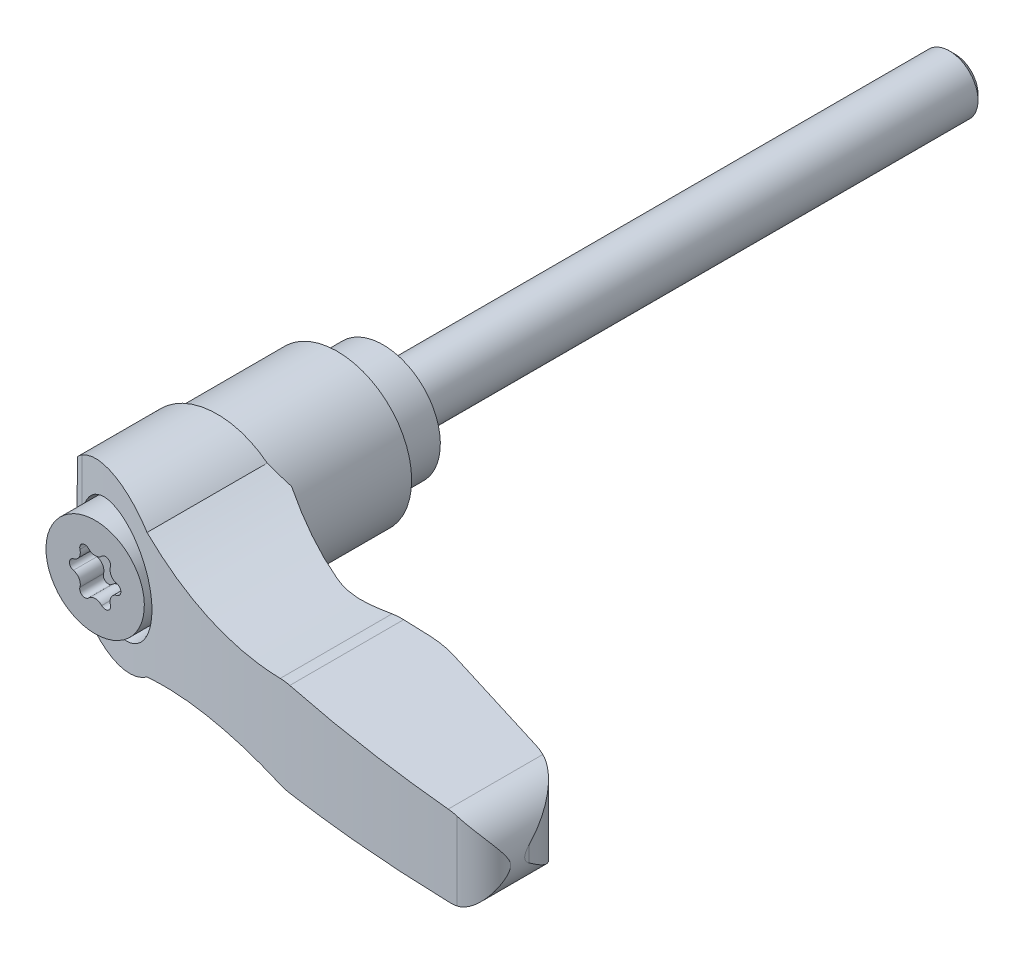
ISO-10303-21;
HEADER;
FILE_DESCRIPTION(('STEP AP214'),'2;1');
FILE_NAME('part.step','',(''),(''),'','','');
FILE_SCHEMA(('AUTOMOTIVE_DESIGN { 1 0 10303 214 1 1 1 1 }'));
ENDSEC;
DATA;
#1=APPLICATION_CONTEXT('core data for automotive mechanical design processes');
#2=APPLICATION_PROTOCOL_DEFINITION('international standard','automotive_design',2000,#1);
#3=PRODUCT_CONTEXT('',#1,'mechanical');
#4=PRODUCT('Part','Part','',(#3));
#5=PRODUCT_RELATED_PRODUCT_CATEGORY('part','',(#4));
#6=PRODUCT_DEFINITION_FORMATION('','',#4);
#7=PRODUCT_DEFINITION_CONTEXT('part definition',#1,'design');
#8=PRODUCT_DEFINITION('design','',#6,#7);
#9=PRODUCT_DEFINITION_SHAPE('','',#8);
#10=(LENGTH_UNIT() NAMED_UNIT(*) SI_UNIT(.MILLI.,.METRE.));
#11=(NAMED_UNIT(*) PLANE_ANGLE_UNIT() SI_UNIT($,.RADIAN.));
#12=(NAMED_UNIT(*) SI_UNIT($,.STERADIAN.) SOLID_ANGLE_UNIT());
#13=UNCERTAINTY_MEASURE_WITH_UNIT(LENGTH_MEASURE(1.E-05),#10,'distance_accuracy_value','');
#14=(GEOMETRIC_REPRESENTATION_CONTEXT(3) GLOBAL_UNCERTAINTY_ASSIGNED_CONTEXT((#13)) GLOBAL_UNIT_ASSIGNED_CONTEXT((#10,
#11,#12)) REPRESENTATION_CONTEXT('',''));
#15=CARTESIAN_POINT('',(0.,0.,0.));
#16=DIRECTION('',(0.,0.,1.));
#17=DIRECTION('',(1.,0.,0.));
#18=AXIS2_PLACEMENT_3D('',#15,#16,#17);
#19=CARTESIAN_POINT('',(2.008532,0.,-50.));
#20=DIRECTION('',(0.,0.,-1.));
#21=DIRECTION('',(0.,1.,0.));
#22=AXIS2_PLACEMENT_3D('',#19,#20,#21);
#23=PLANE('',#22);
#24=CARTESIAN_POINT('',(0.,0.,-50.));
#25=DIRECTION('',(0.,0.,1.));
#26=DIRECTION('',(0.,-1.,0.));
#27=AXIS2_PLACEMENT_3D('',#24,#25,#26);
#28=CIRCLE('',#27,2.008532);
#29=CARTESIAN_POINT('',(0.,-2.008532,-50.));
#30=VERTEX_POINT('',#29);
#31=EDGE_CURVE('E1387',#30,#30,#28,.T.);
#32=ORIENTED_EDGE('',*,*,#31,.F.);
#33=EDGE_LOOP('',(#32));
#34=FACE_BOUND('',#33,.T.);
#35=ADVANCED_FACE('F14',(#34),#23,.T.);
#36=CARTESIAN_POINT('',(0.,0.,-49.508532));
#37=DIRECTION('',(0.,0.,1.));
#38=DIRECTION('',(0.,-1.,0.));
#39=AXIS2_PLACEMENT_3D('',#36,#37,#38);
#40=CONICAL_SURFACE('',#39,2.5,0.785398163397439);
#41=ORIENTED_EDGE('',*,*,#31,.T.);
#42=EDGE_LOOP('',(#41));
#43=FACE_BOUND('',#42,.T.);
#44=CARTESIAN_POINT('',(0.,0.,-49.508532));
#45=DIRECTION('',(0.,0.,1.));
#46=DIRECTION('',(0.,-1.,0.));
#47=AXIS2_PLACEMENT_3D('',#44,#45,#46);
#48=CIRCLE('',#47,2.5);
#49=CARTESIAN_POINT('',(0.,-2.5,-49.508532));
#50=VERTEX_POINT('',#49);
#51=EDGE_CURVE('E1390',#50,#50,#48,.T.);
#52=ORIENTED_EDGE('',*,*,#51,.F.);
#53=EDGE_LOOP('',(#52));
#54=FACE_BOUND('',#53,.T.);
#55=ADVANCED_FACE('F534',(#43,#54),#40,.T.);
#56=CARTESIAN_POINT('',(0.,0.,4.));
#57=DIRECTION('',(0.,0.,1.));
#58=DIRECTION('',(0.,-1.,0.));
#59=AXIS2_PLACEMENT_3D('',#56,#57,#58);
#60=CYLINDRICAL_SURFACE('',#59,2.5);
#61=ORIENTED_EDGE('',*,*,#51,.T.);
#62=EDGE_LOOP('',(#61));
#63=FACE_BOUND('',#62,.T.);
#64=CARTESIAN_POINT('',(0.,0.,0.));
#65=DIRECTION('',(0.,0.,1.));
#66=DIRECTION('',(0.,-1.,0.));
#67=AXIS2_PLACEMENT_3D('',#64,#65,#66);
#68=CIRCLE('',#67,2.5);
#69=CARTESIAN_POINT('',(0.,-2.5,0.));
#70=VERTEX_POINT('',#69);
#71=EDGE_CURVE('E1393',#70,#70,#68,.T.);
#72=ORIENTED_EDGE('',*,*,#71,.F.);
#73=EDGE_LOOP('',(#72));
#74=FACE_BOUND('',#73,.T.);
#75=ADVANCED_FACE('F539',(#63,#74),#60,.T.);
#76=CARTESIAN_POINT('',(5.,0.,0.));
#77=DIRECTION('',(0.,0.,-1.));
#78=DIRECTION('',(0.,1.,0.));
#79=AXIS2_PLACEMENT_3D('',#76,#77,#78);
#80=PLANE('',#79);
#81=ORIENTED_EDGE('',*,*,#71,.T.);
#82=EDGE_LOOP('',(#81));
#83=FACE_BOUND('',#82,.T.);
#84=CARTESIAN_POINT('',(0.,0.,0.));
#85=DIRECTION('',(0.,0.,1.));
#86=DIRECTION('',(0.,-1.,0.));
#87=AXIS2_PLACEMENT_3D('',#84,#85,#86);
#88=CIRCLE('',#87,5.);
#89=CARTESIAN_POINT('',(0.,-5.,0.));
#90=VERTEX_POINT('',#89);
#91=EDGE_CURVE('E1396',#90,#90,#88,.T.);
#92=ORIENTED_EDGE('',*,*,#91,.F.);
#93=EDGE_LOOP('',(#92));
#94=FACE_BOUND('',#93,.T.);
#95=ADVANCED_FACE('F488',(#83,#94),#80,.T.);
#96=CARTESIAN_POINT('',(0.,0.,4.));
#97=DIRECTION('',(0.,0.,1.));
#98=DIRECTION('',(0.,-1.,0.));
#99=AXIS2_PLACEMENT_3D('',#96,#97,#98);
#100=CYLINDRICAL_SURFACE('',#99,5.);
#101=ORIENTED_EDGE('',*,*,#91,.T.);
#102=EDGE_LOOP('',(#101));
#103=FACE_BOUND('',#102,.T.);
#104=CARTESIAN_POINT('',(0.,0.,4.55));
#105=DIRECTION('',(0.,0.,-1.));
#106=DIRECTION('',(1.,0.,0.));
#107=AXIS2_PLACEMENT_3D('',#104,#105,#106);
#108=CIRCLE('',#107,5.);
#109=CARTESIAN_POINT('',(5.,0.,4.55));
#110=VERTEX_POINT('',#109);
#111=EDGE_CURVE('E9',#110,#110,#108,.T.);
#112=ORIENTED_EDGE('',*,*,#111,.T.);
#113=EDGE_LOOP('',(#112));
#114=FACE_BOUND('',#113,.T.);
#115=ADVANCED_FACE('F478',(#103,#114),#100,.T.);
#116=CARTESIAN_POINT('',(-1.94278209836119,0.602050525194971,23.12));
#117=DIRECTION('',(0.,0.,-1.));
#118=DIRECTION('',(0.,1.,0.));
#119=AXIS2_PLACEMENT_3D('',#116,#117,#118);
#120=PLANE('',#119);
#121=CARTESIAN_POINT('',(-2.08556419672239,1.20410105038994,23.12));
#122=DIRECTION('',(0.,0.,-1.));
#123=DIRECTION('',(-1.,0.,0.));
#124=AXIS2_PLACEMENT_3D('',#121,#122,#123);
#125=CIRCLE('',#124,0.787499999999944);
#126=CARTESIAN_POINT('',(-1.3311142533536,1.4298476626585,23.12));
#127=VERTEX_POINT('',#126);
#128=CARTESIAN_POINT('',(-1.9038415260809,0.43785492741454,23.12));
#129=VERTEX_POINT('',#128);
#130=EDGE_CURVE('E1321',#127,#129,#125,.T.);
#131=ORIENTED_EDGE('',*,*,#130,.T.);
#132=CARTESIAN_POINT('',(-1.8,0.,23.12));
#133=DIRECTION('',(0.,0.,1.));
#134=DIRECTION('',(1.,0.,0.));
#135=AXIS2_PLACEMENT_3D('',#132,#133,#134);
#136=CIRCLE('',#135,0.45);
#137=CARTESIAN_POINT('',(-1.9038415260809,-0.43785492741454,23.12));
#138=VERTEX_POINT('',#137);
#139=EDGE_CURVE('E1325',#129,#138,#136,.T.);
#140=ORIENTED_EDGE('',*,*,#139,.T.);
#141=CARTESIAN_POINT('',(-2.08556419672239,-1.20410105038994,23.12));
#142=DIRECTION('',(0.,0.,-1.));
#143=DIRECTION('',(-1.,0.,0.));
#144=AXIS2_PLACEMENT_3D('',#141,#142,#143);
#145=CIRCLE('',#144,0.787499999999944);
#146=CARTESIAN_POINT('',(-1.3311142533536,-1.4298476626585,23.12));
#147=VERTEX_POINT('',#146);
#148=EDGE_CURVE('E267',#138,#147,#145,.T.);
#149=ORIENTED_EDGE('',*,*,#148,.T.);
#150=CARTESIAN_POINT('',(-0.899999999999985,-1.55884572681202,23.12));
#151=DIRECTION('',(0.,0.,1.));
#152=DIRECTION('',(1.,0.,0.));
#153=AXIS2_PLACEMENT_3D('',#150,#151,#152);
#154=CIRCLE('',#153,0.45);
#155=CARTESIAN_POINT('',(-0.57272727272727,-1.8677025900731,23.12));
#156=VERTEX_POINT('',#155);
#157=EDGE_CURVE('E1332',#147,#156,#154,.T.);
#158=ORIENTED_EDGE('',*,*,#157,.T.);
#159=CARTESIAN_POINT('',(0.,-2.40820210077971,23.12));
#160=DIRECTION('',(0.,0.,-1.));
#161=DIRECTION('',(-1.,0.,0.));
#162=AXIS2_PLACEMENT_3D('',#159,#160,#161);
#163=CIRCLE('',#162,0.787499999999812);
#164=CARTESIAN_POINT('',(0.57272727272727,-1.8677025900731,23.12));
#165=VERTEX_POINT('',#164);
#166=EDGE_CURVE('E1336',#156,#165,#163,.T.);
#167=ORIENTED_EDGE('',*,*,#166,.T.);
#168=CARTESIAN_POINT('',(0.899999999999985,-1.55884572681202,23.12));
#169=DIRECTION('',(0.,0.,1.));
#170=DIRECTION('',(-1.,0.,0.));
#171=AXIS2_PLACEMENT_3D('',#168,#169,#170);
#172=CIRCLE('',#171,0.45);
#173=CARTESIAN_POINT('',(1.3311142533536,-1.4298476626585,23.12));
#174=VERTEX_POINT('',#173);
#175=EDGE_CURVE('E1340',#165,#174,#172,.T.);
#176=ORIENTED_EDGE('',*,*,#175,.T.);
#177=CARTESIAN_POINT('',(2.08556419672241,-1.20410105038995,23.12));
#178=DIRECTION('',(0.,0.,-1.));
#179=DIRECTION('',(1.,0.,0.));
#180=AXIS2_PLACEMENT_3D('',#177,#178,#179);
#181=CIRCLE('',#180,0.787499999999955);
#182=CARTESIAN_POINT('',(1.9038415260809,-0.43785492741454,23.12));
#183=VERTEX_POINT('',#182);
#184=EDGE_CURVE('E1344',#174,#183,#181,.T.);
#185=ORIENTED_EDGE('',*,*,#184,.T.);
#186=CARTESIAN_POINT('',(1.8,0.,23.12));
#187=DIRECTION('',(0.,0.,1.));
#188=DIRECTION('',(-1.,0.,0.));
#189=AXIS2_PLACEMENT_3D('',#186,#187,#188);
#190=CIRCLE('',#189,0.45);
#191=CARTESIAN_POINT('',(1.9038415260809,0.43785492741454,23.12));
#192=VERTEX_POINT('',#191);
#193=EDGE_CURVE('E1348',#183,#192,#190,.T.);
#194=ORIENTED_EDGE('',*,*,#193,.T.);
#195=CARTESIAN_POINT('',(2.08556419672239,1.20410105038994,23.12));
#196=DIRECTION('',(0.,0.,-1.));
#197=DIRECTION('',(1.,0.,0.));
#198=AXIS2_PLACEMENT_3D('',#195,#196,#197);
#199=CIRCLE('',#198,0.787499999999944);
#200=CARTESIAN_POINT('',(1.3311142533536,1.4298476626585,23.12));
#201=VERTEX_POINT('',#200);
#202=EDGE_CURVE('E1352',#192,#201,#199,.T.);
#203=ORIENTED_EDGE('',*,*,#202,.T.);
#204=CARTESIAN_POINT('',(0.899999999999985,1.55884572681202,23.12));
#205=DIRECTION('',(0.,0.,1.));
#206=DIRECTION('',(-1.,0.,0.));
#207=AXIS2_PLACEMENT_3D('',#204,#205,#206);
#208=CIRCLE('',#207,0.45);
#209=CARTESIAN_POINT('',(0.57272727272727,1.8677025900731,23.12));
#210=VERTEX_POINT('',#209);
#211=EDGE_CURVE('E1356',#201,#210,#208,.T.);
#212=ORIENTED_EDGE('',*,*,#211,.T.);
#213=CARTESIAN_POINT('',(0.,2.40820210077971,23.12));
#214=DIRECTION('',(0.,0.,-1.));
#215=DIRECTION('',(-1.,0.,0.));
#216=AXIS2_PLACEMENT_3D('',#213,#214,#215);
#217=CIRCLE('',#216,0.787499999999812);
#218=CARTESIAN_POINT('',(-0.57272727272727,1.8677025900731,23.12));
#219=VERTEX_POINT('',#218);
#220=EDGE_CURVE('E1360',#210,#219,#217,.T.);
#221=ORIENTED_EDGE('',*,*,#220,.T.);
#222=CARTESIAN_POINT('',(-0.899999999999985,1.55884572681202,23.12));
#223=DIRECTION('',(0.,0.,1.));
#224=DIRECTION('',(1.,0.,0.));
#225=AXIS2_PLACEMENT_3D('',#222,#223,#224);
#226=CIRCLE('',#225,0.45);
#227=EDGE_CURVE('E1364',#219,#127,#226,.T.);
#228=ORIENTED_EDGE('',*,*,#227,.T.);
#229=EDGE_LOOP('',(#131,#140,#149,#158,#167,#176,#185,#194,#203,#212,#221,#228));
#230=FACE_BOUND('',#229,.T.);
#231=ADVANCED_FACE('F476',(#230),#120,.F.);
#232=CARTESIAN_POINT('',(-2.08556419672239,-1.20410105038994,27.24));
#233=DIRECTION('',(0.,0.,-1.));
#234=DIRECTION('',(0.,1.,0.));
#235=AXIS2_PLACEMENT_3D('',#232,#233,#234);
#236=CYLINDRICAL_SURFACE('',#235,0.787499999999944);
#237=DIRECTION('',(0.,0.,-1.));
#238=VECTOR('',#237,1.);
#239=CARTESIAN_POINT('',(-1.3311142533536,-1.4298476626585,27.24));
#240=LINE('',#239,#238);
#241=CARTESIAN_POINT('',(-1.3311142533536,-1.4298476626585,25.18));
#242=VERTEX_POINT('',#241);
#243=EDGE_CURVE('E268',#242,#147,#240,.T.);
#244=ORIENTED_EDGE('',*,*,#243,.T.);
#245=ORIENTED_EDGE('',*,*,#148,.F.);
#246=DIRECTION('',(0.,0.,-1.));
#247=VECTOR('',#246,1.);
#248=CARTESIAN_POINT('',(-1.9038415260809,-0.43785492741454,27.24));
#249=LINE('',#248,#247);
#250=CARTESIAN_POINT('',(-1.9038415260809,-0.43785492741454,25.18));
#251=VERTEX_POINT('',#250);
#252=EDGE_CURVE('E255',#251,#138,#249,.T.);
#253=ORIENTED_EDGE('',*,*,#252,.F.);
#254=CARTESIAN_POINT('',(-2.08556419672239,-1.20410105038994,25.18));
#255=DIRECTION('',(0.,0.,1.));
#256=DIRECTION('',(0.,-1.,0.));
#257=AXIS2_PLACEMENT_3D('',#254,#255,#256);
#258=CIRCLE('',#257,0.787499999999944);
#259=EDGE_CURVE('E260',#242,#251,#258,.T.);
#260=ORIENTED_EDGE('',*,*,#259,.F.);
#261=EDGE_LOOP('',(#244,#245,#253,#260));
#262=FACE_BOUND('',#261,.T.);
#263=ADVANCED_FACE('F264',(#262),#236,.T.);
#264=CARTESIAN_POINT('',(-0.899999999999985,-1.55884572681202,27.24));
#265=DIRECTION('',(0.,0.,-1.));
#266=DIRECTION('',(0.,1.,0.));
#267=AXIS2_PLACEMENT_3D('',#264,#265,#266);
#268=CYLINDRICAL_SURFACE('',#267,0.45);
#269=DIRECTION('',(0.,0.,-1.));
#270=VECTOR('',#269,1.);
#271=CARTESIAN_POINT('',(-0.57272727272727,-1.8677025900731,27.24));
#272=LINE('',#271,#270);
#273=CARTESIAN_POINT('',(-0.57272727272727,-1.8677025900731,25.18));
#274=VERTEX_POINT('',#273);
#275=EDGE_CURVE('E1383',#274,#156,#272,.T.);
#276=ORIENTED_EDGE('',*,*,#275,.T.);
#277=ORIENTED_EDGE('',*,*,#157,.F.);
#278=ORIENTED_EDGE('',*,*,#243,.F.);
#279=CARTESIAN_POINT('',(-0.899999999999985,-1.55884572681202,25.18));
#280=DIRECTION('',(0.,0.,1.));
#281=DIRECTION('',(0.,-1.,0.));
#282=AXIS2_PLACEMENT_3D('',#279,#280,#281);
#283=CIRCLE('',#282,0.45);
#284=EDGE_CURVE('E273',#274,#242,#283,.F.);
#285=ORIENTED_EDGE('',*,*,#284,.F.);
#286=EDGE_LOOP('',(#276,#277,#278,#285));
#287=FACE_BOUND('',#286,.T.);
#288=ADVANCED_FACE('F486',(#287),#268,.F.);
#289=CARTESIAN_POINT('',(0.,-2.40820210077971,27.24));
#290=DIRECTION('',(0.,0.,-1.));
#291=DIRECTION('',(0.,1.,0.));
#292=AXIS2_PLACEMENT_3D('',#289,#290,#291);
#293=CYLINDRICAL_SURFACE('',#292,0.787499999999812);
#294=DIRECTION('',(0.,0.,-1.));
#295=VECTOR('',#294,1.);
#296=CARTESIAN_POINT('',(0.57272727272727,-1.8677025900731,27.24));
#297=LINE('',#296,#295);
#298=CARTESIAN_POINT('',(0.57272727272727,-1.8677025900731,25.18));
#299=VERTEX_POINT('',#298);
#300=EDGE_CURVE('E1381',#299,#165,#297,.T.);
#301=ORIENTED_EDGE('',*,*,#300,.T.);
#302=ORIENTED_EDGE('',*,*,#166,.F.);
#303=ORIENTED_EDGE('',*,*,#275,.F.);
#304=CARTESIAN_POINT('',(0.,-2.40820210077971,25.18));
#305=DIRECTION('',(0.,0.,1.));
#306=DIRECTION('',(0.,-1.,0.));
#307=AXIS2_PLACEMENT_3D('',#304,#305,#306);
#308=CIRCLE('',#307,0.787499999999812);
#309=EDGE_CURVE('E275',#299,#274,#308,.T.);
#310=ORIENTED_EDGE('',*,*,#309,.F.);
#311=EDGE_LOOP('',(#301,#302,#303,#310));
#312=FACE_BOUND('',#311,.T.);
#313=ADVANCED_FACE('F520',(#312),#293,.T.);
#314=CARTESIAN_POINT('',(0.899999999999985,-1.55884572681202,27.24));
#315=DIRECTION('',(0.,0.,-1.));
#316=DIRECTION('',(0.,1.,0.));
#317=AXIS2_PLACEMENT_3D('',#314,#315,#316);
#318=CYLINDRICAL_SURFACE('',#317,0.45);
#319=DIRECTION('',(0.,0.,-1.));
#320=VECTOR('',#319,1.);
#321=CARTESIAN_POINT('',(1.3311142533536,-1.4298476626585,27.24));
#322=LINE('',#321,#320);
#323=CARTESIAN_POINT('',(1.3311142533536,-1.4298476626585,25.18));
#324=VERTEX_POINT('',#323);
#325=EDGE_CURVE('E1379',#324,#174,#322,.T.);
#326=ORIENTED_EDGE('',*,*,#325,.T.);
#327=ORIENTED_EDGE('',*,*,#175,.F.);
#328=ORIENTED_EDGE('',*,*,#300,.F.);
#329=CARTESIAN_POINT('',(0.899999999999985,-1.55884572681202,25.18));
#330=DIRECTION('',(0.,0.,1.));
#331=DIRECTION('',(0.,-1.,0.));
#332=AXIS2_PLACEMENT_3D('',#329,#330,#331);
#333=CIRCLE('',#332,0.45);
#334=EDGE_CURVE('E1420',#324,#299,#333,.F.);
#335=ORIENTED_EDGE('',*,*,#334,.F.);
#336=EDGE_LOOP('',(#326,#327,#328,#335));
#337=FACE_BOUND('',#336,.T.);
#338=ADVANCED_FACE('F516',(#337),#318,.F.);
#339=CARTESIAN_POINT('',(2.08556419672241,-1.20410105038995,27.24));
#340=DIRECTION('',(0.,0.,-1.));
#341=DIRECTION('',(0.,1.,0.));
#342=AXIS2_PLACEMENT_3D('',#339,#340,#341);
#343=CYLINDRICAL_SURFACE('',#342,0.787499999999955);
#344=DIRECTION('',(0.,0.,-1.));
#345=VECTOR('',#344,1.);
#346=CARTESIAN_POINT('',(1.9038415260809,-0.43785492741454,27.24));
#347=LINE('',#346,#345);
#348=CARTESIAN_POINT('',(1.9038415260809,-0.43785492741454,25.18));
#349=VERTEX_POINT('',#348);
#350=EDGE_CURVE('E1377',#349,#183,#347,.T.);
#351=ORIENTED_EDGE('',*,*,#350,.T.);
#352=ORIENTED_EDGE('',*,*,#184,.F.);
#353=ORIENTED_EDGE('',*,*,#325,.F.);
#354=CARTESIAN_POINT('',(2.08556419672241,-1.20410105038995,25.18));
#355=DIRECTION('',(0.,0.,1.));
#356=DIRECTION('',(0.,-1.,0.));
#357=AXIS2_PLACEMENT_3D('',#354,#355,#356);
#358=CIRCLE('',#357,0.787499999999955);
#359=EDGE_CURVE('E1417',#349,#324,#358,.T.);
#360=ORIENTED_EDGE('',*,*,#359,.F.);
#361=EDGE_LOOP('',(#351,#352,#353,#360));
#362=FACE_BOUND('',#361,.T.);
#363=ADVANCED_FACE('F512',(#362),#343,.T.);
#364=CARTESIAN_POINT('',(1.8,0.,27.24));
#365=DIRECTION('',(0.,0.,-1.));
#366=DIRECTION('',(0.,1.,0.));
#367=AXIS2_PLACEMENT_3D('',#364,#365,#366);
#368=CYLINDRICAL_SURFACE('',#367,0.45);
#369=DIRECTION('',(0.,0.,-1.));
#370=VECTOR('',#369,1.);
#371=CARTESIAN_POINT('',(1.9038415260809,0.43785492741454,27.24));
#372=LINE('',#371,#370);
#373=CARTESIAN_POINT('',(1.9038415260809,0.43785492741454,25.18));
#374=VERTEX_POINT('',#373);
#375=EDGE_CURVE('E1375',#374,#192,#372,.T.);
#376=ORIENTED_EDGE('',*,*,#375,.T.);
#377=ORIENTED_EDGE('',*,*,#193,.F.);
#378=ORIENTED_EDGE('',*,*,#350,.F.);
#379=CARTESIAN_POINT('',(1.8,0.,25.18));
#380=DIRECTION('',(0.,0.,1.));
#381=DIRECTION('',(0.,-1.,0.));
#382=AXIS2_PLACEMENT_3D('',#379,#380,#381);
#383=CIRCLE('',#382,0.45);
#384=EDGE_CURVE('E1414',#374,#349,#383,.F.);
#385=ORIENTED_EDGE('',*,*,#384,.F.);
#386=EDGE_LOOP('',(#376,#377,#378,#385));
#387=FACE_BOUND('',#386,.T.);
#388=ADVANCED_FACE('F508',(#387),#368,.F.);
#389=CARTESIAN_POINT('',(2.08556419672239,1.20410105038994,27.24));
#390=DIRECTION('',(0.,0.,-1.));
#391=DIRECTION('',(0.,1.,0.));
#392=AXIS2_PLACEMENT_3D('',#389,#390,#391);
#393=CYLINDRICAL_SURFACE('',#392,0.787499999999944);
#394=DIRECTION('',(0.,0.,-1.));
#395=VECTOR('',#394,1.);
#396=CARTESIAN_POINT('',(1.3311142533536,1.4298476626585,27.24));
#397=LINE('',#396,#395);
#398=CARTESIAN_POINT('',(1.3311142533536,1.4298476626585,25.18));
#399=VERTEX_POINT('',#398);
#400=EDGE_CURVE('E1373',#399,#201,#397,.T.);
#401=ORIENTED_EDGE('',*,*,#400,.T.);
#402=ORIENTED_EDGE('',*,*,#202,.F.);
#403=ORIENTED_EDGE('',*,*,#375,.F.);
#404=CARTESIAN_POINT('',(2.08556419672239,1.20410105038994,25.18));
#405=DIRECTION('',(0.,0.,1.));
#406=DIRECTION('',(0.,-1.,0.));
#407=AXIS2_PLACEMENT_3D('',#404,#405,#406);
#408=CIRCLE('',#407,0.787499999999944);
#409=EDGE_CURVE('E1411',#399,#374,#408,.T.);
#410=ORIENTED_EDGE('',*,*,#409,.F.);
#411=EDGE_LOOP('',(#401,#402,#403,#410));
#412=FACE_BOUND('',#411,.T.);
#413=ADVANCED_FACE('F504',(#412),#393,.T.);
#414=CARTESIAN_POINT('',(0.899999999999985,1.55884572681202,27.24));
#415=DIRECTION('',(0.,0.,-1.));
#416=DIRECTION('',(0.,1.,0.));
#417=AXIS2_PLACEMENT_3D('',#414,#415,#416);
#418=CYLINDRICAL_SURFACE('',#417,0.45);
#419=DIRECTION('',(0.,0.,-1.));
#420=VECTOR('',#419,1.);
#421=CARTESIAN_POINT('',(0.57272727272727,1.8677025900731,27.24));
#422=LINE('',#421,#420);
#423=CARTESIAN_POINT('',(0.57272727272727,1.8677025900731,25.18));
#424=VERTEX_POINT('',#423);
#425=EDGE_CURVE('E1371',#424,#210,#422,.T.);
#426=ORIENTED_EDGE('',*,*,#425,.T.);
#427=ORIENTED_EDGE('',*,*,#211,.F.);
#428=ORIENTED_EDGE('',*,*,#400,.F.);
#429=CARTESIAN_POINT('',(0.899999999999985,1.55884572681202,25.18));
#430=DIRECTION('',(0.,0.,1.));
#431=DIRECTION('',(0.,-1.,0.));
#432=AXIS2_PLACEMENT_3D('',#429,#430,#431);
#433=CIRCLE('',#432,0.45);
#434=EDGE_CURVE('E1408',#424,#399,#433,.F.);
#435=ORIENTED_EDGE('',*,*,#434,.F.);
#436=EDGE_LOOP('',(#426,#427,#428,#435));
#437=FACE_BOUND('',#436,.T.);
#438=ADVANCED_FACE('F500',(#437),#418,.F.);
#439=CARTESIAN_POINT('',(0.,2.40820210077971,27.24));
#440=DIRECTION('',(0.,0.,-1.));
#441=DIRECTION('',(0.,1.,0.));
#442=AXIS2_PLACEMENT_3D('',#439,#440,#441);
#443=CYLINDRICAL_SURFACE('',#442,0.787499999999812);
#444=DIRECTION('',(0.,0.,-1.));
#445=VECTOR('',#444,1.);
#446=CARTESIAN_POINT('',(-0.57272727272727,1.8677025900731,27.24));
#447=LINE('',#446,#445);
#448=CARTESIAN_POINT('',(-0.57272727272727,1.8677025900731,25.18));
#449=VERTEX_POINT('',#448);
#450=EDGE_CURVE('E39',#449,#219,#447,.T.);
#451=ORIENTED_EDGE('',*,*,#450,.T.);
#452=ORIENTED_EDGE('',*,*,#220,.F.);
#453=ORIENTED_EDGE('',*,*,#425,.F.);
#454=CARTESIAN_POINT('',(0.,2.40820210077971,25.18));
#455=DIRECTION('',(0.,0.,1.));
#456=DIRECTION('',(0.,-1.,0.));
#457=AXIS2_PLACEMENT_3D('',#454,#455,#456);
#458=CIRCLE('',#457,0.787499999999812);
#459=EDGE_CURVE('E1405',#449,#424,#458,.T.);
#460=ORIENTED_EDGE('',*,*,#459,.F.);
#461=EDGE_LOOP('',(#451,#452,#453,#460));
#462=FACE_BOUND('',#461,.T.);
#463=ADVANCED_FACE('F497',(#462),#443,.T.);
#464=CARTESIAN_POINT('',(-0.899999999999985,1.55884572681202,27.24));
#465=DIRECTION('',(0.,0.,-1.));
#466=DIRECTION('',(0.,1.,0.));
#467=AXIS2_PLACEMENT_3D('',#464,#465,#466);
#468=CYLINDRICAL_SURFACE('',#467,0.45);
#469=DIRECTION('',(0.,0.,-1.));
#470=VECTOR('',#469,1.);
#471=CARTESIAN_POINT('',(-1.3311142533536,1.4298476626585,27.24));
#472=LINE('',#471,#470);
#473=CARTESIAN_POINT('',(-1.3311142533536,1.4298476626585,25.18));
#474=VERTEX_POINT('',#473);
#475=EDGE_CURVE('E1367',#474,#127,#472,.T.);
#476=ORIENTED_EDGE('',*,*,#475,.T.);
#477=ORIENTED_EDGE('',*,*,#227,.F.);
#478=ORIENTED_EDGE('',*,*,#450,.F.);
#479=CARTESIAN_POINT('',(-0.899999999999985,1.55884572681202,25.18));
#480=DIRECTION('',(0.,0.,1.));
#481=DIRECTION('',(0.,-1.,0.));
#482=AXIS2_PLACEMENT_3D('',#479,#480,#481);
#483=CIRCLE('',#482,0.45);
#484=EDGE_CURVE('E1402',#474,#449,#483,.F.);
#485=ORIENTED_EDGE('',*,*,#484,.F.);
#486=EDGE_LOOP('',(#476,#477,#478,#485));
#487=FACE_BOUND('',#486,.T.);
#488=ADVANCED_FACE('F493',(#487),#468,.F.);
#489=CARTESIAN_POINT('',(-2.08556419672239,1.20410105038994,27.24));
#490=DIRECTION('',(0.,0.,-1.));
#491=DIRECTION('',(0.,1.,0.));
#492=AXIS2_PLACEMENT_3D('',#489,#490,#491);
#493=CYLINDRICAL_SURFACE('',#492,0.787499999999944);
#494=DIRECTION('',(0.,0.,-1.));
#495=VECTOR('',#494,1.);
#496=CARTESIAN_POINT('',(-1.9038415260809,0.43785492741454,27.24));
#497=LINE('',#496,#495);
#498=CARTESIAN_POINT('',(-1.9038415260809,0.43785492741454,25.18));
#499=VERTEX_POINT('',#498);
#500=EDGE_CURVE('E190',#499,#129,#497,.T.);
#501=ORIENTED_EDGE('',*,*,#500,.T.);
#502=ORIENTED_EDGE('',*,*,#130,.F.);
#503=ORIENTED_EDGE('',*,*,#475,.F.);
#504=CARTESIAN_POINT('',(-2.08556419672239,1.20410105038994,25.18));
#505=DIRECTION('',(0.,0.,1.));
#506=DIRECTION('',(0.,-1.,0.));
#507=AXIS2_PLACEMENT_3D('',#504,#505,#506);
#508=CIRCLE('',#507,0.787499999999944);
#509=EDGE_CURVE('E30',#499,#474,#508,.T.);
#510=ORIENTED_EDGE('',*,*,#509,.F.);
#511=EDGE_LOOP('',(#501,#502,#503,#510));
#512=FACE_BOUND('',#511,.T.);
#513=ADVANCED_FACE('F496',(#512),#493,.T.);
#514=CARTESIAN_POINT('',(-1.8,0.,27.24));
#515=DIRECTION('',(0.,0.,-1.));
#516=DIRECTION('',(0.,1.,0.));
#517=AXIS2_PLACEMENT_3D('',#514,#515,#516);
#518=CYLINDRICAL_SURFACE('',#517,0.45);
#519=ORIENTED_EDGE('',*,*,#252,.T.);
#520=ORIENTED_EDGE('',*,*,#139,.F.);
#521=ORIENTED_EDGE('',*,*,#500,.F.);
#522=CARTESIAN_POINT('',(-1.8,0.,25.18));
#523=DIRECTION('',(0.,0.,1.));
#524=DIRECTION('',(0.,-1.,0.));
#525=AXIS2_PLACEMENT_3D('',#522,#523,#524);
#526=CIRCLE('',#525,0.45);
#527=EDGE_CURVE('E252',#251,#499,#526,.F.);
#528=ORIENTED_EDGE('',*,*,#527,.F.);
#529=EDGE_LOOP('',(#519,#520,#521,#528));
#530=FACE_BOUND('',#529,.T.);
#531=ADVANCED_FACE('F254',(#530),#518,.F.);
#532=CARTESIAN_POINT('',(0.,0.,25.18));
#533=DIRECTION('',(0.,0.,1.));
#534=DIRECTION('',(0.,-1.,0.));
#535=AXIS2_PLACEMENT_3D('',#532,#533,#534);
#536=PLANE('',#535);
#537=CARTESIAN_POINT('',(0.,0.,25.18));
#538=DIRECTION('',(0.,0.,1.));
#539=DIRECTION('',(0.,-1.,0.));
#540=AXIS2_PLACEMENT_3D('',#537,#538,#539);
#541=CIRCLE('',#540,4.3);
#542=CARTESIAN_POINT('',(0.,-4.3,25.18));
#543=VERTEX_POINT('',#542);
#544=EDGE_CURVE('E1399',#543,#543,#541,.T.);
#545=ORIENTED_EDGE('',*,*,#544,.T.);
#546=EDGE_LOOP('',(#545));
#547=FACE_BOUND('',#546,.T.);
#548=ORIENTED_EDGE('',*,*,#527,.T.);
#549=ORIENTED_EDGE('',*,*,#509,.T.);
#550=ORIENTED_EDGE('',*,*,#484,.T.);
#551=ORIENTED_EDGE('',*,*,#459,.T.);
#552=ORIENTED_EDGE('',*,*,#434,.T.);
#553=ORIENTED_EDGE('',*,*,#409,.T.);
#554=ORIENTED_EDGE('',*,*,#384,.T.);
#555=ORIENTED_EDGE('',*,*,#359,.T.);
#556=ORIENTED_EDGE('',*,*,#334,.T.);
#557=ORIENTED_EDGE('',*,*,#309,.T.);
#558=ORIENTED_EDGE('',*,*,#284,.T.);
#559=ORIENTED_EDGE('',*,*,#259,.T.);
#560=EDGE_LOOP('',(#548,#549,#550,#551,#552,#553,#554,#555,#556,#557,#558,#559));
#561=FACE_BOUND('',#560,.T.);
#562=ADVANCED_FACE('F271',(#547,#561),#536,.T.);
#563=CARTESIAN_POINT('',(0.,0.,4.));
#564=DIRECTION('',(0.,0.,1.));
#565=DIRECTION('',(0.,-1.,0.));
#566=AXIS2_PLACEMENT_3D('',#563,#564,#565);
#567=CYLINDRICAL_SURFACE('',#566,4.3);
#568=CARTESIAN_POINT('',(0.,0.,21.34));
#569=DIRECTION('',(0.,0.,-1.));
#570=DIRECTION('',(0.,1.,0.));
#571=AXIS2_PLACEMENT_3D('',#568,#569,#570);
#572=CIRCLE('',#571,4.3);
#573=CARTESIAN_POINT('',(0.,4.3,21.34));
#574=VERTEX_POINT('',#573);
#575=EDGE_CURVE('E571',#574,#574,#572,.F.);
#576=ORIENTED_EDGE('',*,*,#575,.T.);
#577=EDGE_LOOP('',(#576));
#578=FACE_BOUND('',#577,.T.);
#579=ORIENTED_EDGE('',*,*,#544,.F.);
#580=EDGE_LOOP('',(#579));
#581=FACE_BOUND('',#580,.T.);
#582=ADVANCED_FACE('F547',(#578,#581),#567,.T.);
#583=CARTESIAN_POINT('',(-0.009999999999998,0.,16.5625));
#584=DIRECTION('',(0.,0.,-1.));
#585=DIRECTION('',(1.,0.,0.));
#586=AXIS2_PLACEMENT_3D('',#583,#584,#585);
#587=CYLINDRICAL_SURFACE('',#586,6.5);
#588=CARTESIAN_POINT('',(-0.0099999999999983,0.,14.5));
#589=DIRECTION('',(0.,0.,1.));
#590=DIRECTION('',(0.,-1.,0.));
#591=AXIS2_PLACEMENT_3D('',#588,#589,#590);
#592=CIRCLE('',#591,6.5);
#593=CARTESIAN_POINT('',(-6.51,0.,14.5));
#594=VERTEX_POINT('',#593);
#595=CARTESIAN_POINT('',(6.49,0.,14.5));
#596=VERTEX_POINT('',#595);
#597=EDGE_CURVE('E638',#594,#596,#592,.T.);
#598=ORIENTED_EDGE('',*,*,#597,.F.);
#599=EDGE_CURVE('E637',#596,#594,#592,.T.);
#600=ORIENTED_EDGE('',*,*,#599,.F.);
#601=EDGE_LOOP('',(#598,#600));
#602=FACE_BOUND('',#601,.T.);
#603=CARTESIAN_POINT('',(-0.0100000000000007,0.,-2.35002265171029));
#604=DIRECTION('',(0.707106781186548,0.,0.707106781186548));
#605=DIRECTION('',(0.707106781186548,0.,-0.707106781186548));
#606=AXIS2_PLACEMENT_3D('',#603,#604,#605);
#607=ELLIPSE('',#606,9.19238815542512,6.5);
#608=CARTESIAN_POINT('',(-6.3600226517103,-1.38824072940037,4.));
#609=VERTEX_POINT('',#608);
#610=CARTESIAN_POINT('',(-6.3600226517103,1.38824072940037,4.));
#611=VERTEX_POINT('',#610);
#612=EDGE_CURVE('E758',#609,#611,#607,.F.);
#613=ORIENTED_EDGE('',*,*,#612,.F.);
#614=CARTESIAN_POINT('',(-0.0099999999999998,0.,4.));
#615=DIRECTION('',(0.,0.,-1.));
#616=DIRECTION('',(1.,0.,0.));
#617=AXIS2_PLACEMENT_3D('',#614,#615,#616);
#618=CIRCLE('',#617,6.5);
#619=EDGE_CURVE('E176',#611,#609,#618,.T.);
#620=ORIENTED_EDGE('',*,*,#619,.F.);
#621=EDGE_LOOP('',(#613,#620));
#622=FACE_BOUND('',#621,.T.);
#623=ADVANCED_FACE('F308',(#602,#622),#587,.T.);
#624=CARTESIAN_POINT('',(-6.51,-14.,4.1499773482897));
#625=DIRECTION('',(0.707106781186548,0.,0.707106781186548));
#626=DIRECTION('',(-0.707106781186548,0.,0.707106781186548));
#627=AXIS2_PLACEMENT_3D('',#624,#625,#626);
#628=PLANE('',#627);
#629=ORIENTED_EDGE('',*,*,#612,.T.);
#630=DIRECTION('',(0.,1.,0.));
#631=VECTOR('',#630,1.);
#632=CARTESIAN_POINT('',(-6.3600226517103,-14.,4.));
#633=LINE('',#632,#631);
#634=EDGE_CURVE('E289',#609,#611,#633,.T.);
#635=ORIENTED_EDGE('',*,*,#634,.F.);
#636=EDGE_LOOP('',(#629,#635));
#637=FACE_BOUND('',#636,.T.);
#638=ADVANCED_FACE('F302',(#637),#628,.F.);
#639=CARTESIAN_POINT('',(-0.0099999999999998,0.,4.));
#640=DIRECTION('',(0.,0.,-1.));
#641=DIRECTION('',(1.,0.,0.));
#642=AXIS2_PLACEMENT_3D('',#639,#640,#641);
#643=PLANE('',#642);
#644=CARTESIAN_POINT('',(0.,0.,4.));
#645=DIRECTION('',(0.,0.,-1.));
#646=DIRECTION('',(1.,0.,0.));
#647=AXIS2_PLACEMENT_3D('',#644,#645,#646);
#648=CIRCLE('',#647,5.25);
#649=CARTESIAN_POINT('',(5.25,0.,4.));
#650=VERTEX_POINT('',#649);
#651=EDGE_CURVE('E566',#650,#650,#648,.T.);
#652=ORIENTED_EDGE('',*,*,#651,.F.);
#653=EDGE_LOOP('',(#652));
#654=FACE_BOUND('',#653,.T.);
#655=ORIENTED_EDGE('',*,*,#634,.T.);
#656=ORIENTED_EDGE('',*,*,#619,.T.);
#657=EDGE_LOOP('',(#655,#656));
#658=FACE_BOUND('',#657,.T.);
#659=ADVANCED_FACE('F307',(#654,#658),#643,.T.);
#660=CARTESIAN_POINT('',(0.,0.,4.));
#661=DIRECTION('',(0.,0.,1.));
#662=DIRECTION('',(0.,-1.,0.));
#663=AXIS2_PLACEMENT_3D('',#660,#661,#662);
#664=CYLINDRICAL_SURFACE('',#663,5.25);
#665=ORIENTED_EDGE('',*,*,#651,.T.);
#666=EDGE_LOOP('',(#665));
#667=FACE_BOUND('',#666,.T.);
#668=CARTESIAN_POINT('',(0.,0.,4.3));
#669=DIRECTION('',(0.,0.,1.));
#670=DIRECTION('',(0.,-1.,0.));
#671=AXIS2_PLACEMENT_3D('',#668,#669,#670);
#672=CIRCLE('',#671,5.25);
#673=CARTESIAN_POINT('',(0.,-5.25,4.3));
#674=VERTEX_POINT('',#673);
#675=EDGE_CURVE('E280',#674,#674,#672,.T.);
#676=ORIENTED_EDGE('',*,*,#675,.T.);
#677=EDGE_LOOP('',(#676));
#678=FACE_BOUND('',#677,.T.);
#679=ADVANCED_FACE('F536',(#667,#678),#664,.F.);
#680=CARTESIAN_POINT('',(0.,0.,4.55));
#681=DIRECTION('',(0.,0.,-1.));
#682=DIRECTION('',(0.,1.,0.));
#683=AXIS2_PLACEMENT_3D('',#680,#681,#682);
#684=CONICAL_SURFACE('',#683,5.,0.785398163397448);
#685=ORIENTED_EDGE('',*,*,#675,.F.);
#686=EDGE_LOOP('',(#685));
#687=FACE_BOUND('',#686,.T.);
#688=ORIENTED_EDGE('',*,*,#111,.F.);
#689=EDGE_LOOP('',(#688));
#690=FACE_BOUND('',#689,.T.);
#691=ADVANCED_FACE('F301',(#687,#690),#684,.F.);
#692=CARTESIAN_POINT('',(39.938965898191,-8.,27.204249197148));
#693=DIRECTION('',(-0.989626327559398,0.,0.143665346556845));
#694=DIRECTION('',(-0.143665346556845,0.,-0.989626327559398));
#695=AXIS2_PLACEMENT_3D('',#692,#693,#694);
#696=PLANE('',#695);
#697=CARTESIAN_POINT('',(36.5,0.,3.51522972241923));
#698=DIRECTION('',(-0.989626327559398,0.,0.143665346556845));
#699=DIRECTION('',(0.143665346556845,0.,0.989626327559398));
#700=AXIS2_PLACEMENT_3D('',#697,#698,#699);
#701=ELLIPSE('',#700,24.3621728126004,3.5);
#702=CARTESIAN_POINT('',(39.938965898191,-0.650779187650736,27.204249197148));
#703=VERTEX_POINT('',#702);
#704=CARTESIAN_POINT('',(39.938965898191,0.650779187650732,27.204249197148));
#705=VERTEX_POINT('',#704);
#706=EDGE_CURVE('E449',#703,#705,#701,.T.);
#707=ORIENTED_EDGE('',*,*,#706,.F.);
#708=DIRECTION('',(0.,1.,0.));
#709=VECTOR('',#708,1.);
#710=CARTESIAN_POINT('',(39.938965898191,-8.,27.204249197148));
#711=LINE('',#710,#709);
#712=EDGE_CURVE('E624',#703,#705,#711,.T.);
#713=ORIENTED_EDGE('',*,*,#712,.T.);
#714=EDGE_LOOP('',(#707,#713));
#715=FACE_BOUND('',#714,.T.);
#716=ADVANCED_FACE('F461',(#715),#696,.F.);
#717=CARTESIAN_POINT('',(33.8626602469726,-8.,28.0863544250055));
#718=DIRECTION('',(0.,1.,0.));
#719=DIRECTION('',(-1.,0.,0.));
#720=AXIS2_PLACEMENT_3D('',#717,#718,#719);
#721=CYLINDRICAL_SURFACE('',#720,6.14000000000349);
#722=CARTESIAN_POINT('',(33.8626602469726,3.59762871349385,28.0863544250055));
#723=DIRECTION('',(0.0369925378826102,0.999315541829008,0.));
#724=DIRECTION('',(-0.999315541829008,0.0369925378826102,0.));
#725=AXIS2_PLACEMENT_3D('',#722,#723,#724);
#726=ELLIPSE('',#725,6.14420545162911,6.14000000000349);
#727=CARTESIAN_POINT('',(36.5,3.5,22.5416236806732));
#728=VERTEX_POINT('',#727);
#729=CARTESIAN_POINT('',(35.534460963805,3.53574220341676,22.178335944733));
#730=VERTEX_POINT('',#729);
#731=EDGE_CURVE('E733',#728,#730,#726,.T.);
#732=ORIENTED_EDGE('',*,*,#731,.F.);
#733=CARTESIAN_POINT('',(39.938965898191,0.650779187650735,27.204249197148));
#734=CARTESIAN_POINT('',(39.9247028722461,0.726086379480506,27.1059853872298));
#735=CARTESIAN_POINT('',(39.9079968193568,0.800887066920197,27.007686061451));
#736=CARTESIAN_POINT('',(39.8696347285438,0.949458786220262,26.8112602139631));
#737=CARTESIAN_POINT('',(39.8479781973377,1.02322971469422,26.7131337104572));
#738=CARTESIAN_POINT('',(39.7995979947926,1.16988012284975,26.5170899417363));
#739=CARTESIAN_POINT('',(39.7728626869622,1.24275713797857,26.4191736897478));
#740=CARTESIAN_POINT('',(39.7142815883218,1.38725410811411,26.2239599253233));
#741=CARTESIAN_POINT('',(39.6824358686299,1.45887408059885,26.1266624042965));
#742=CARTESIAN_POINT('',(39.5782917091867,1.67318502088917,25.8337016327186));
#743=CARTESIAN_POINT('',(39.4979263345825,1.81366367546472,25.6391889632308));
#744=CARTESIAN_POINT('',(39.3150854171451,2.08619457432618,25.2551202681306));
#745=CARTESIAN_POINT('',(39.2126344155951,2.21825596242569,25.0655590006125));
#746=CARTESIAN_POINT('',(38.9595027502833,2.49877334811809,24.6523338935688));
#747=CARTESIAN_POINT('',(38.8031801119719,2.64456339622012,24.4302018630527));
#748=CARTESIAN_POINT('',(38.5417124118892,2.84488994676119,24.108275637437));
#749=CARTESIAN_POINT('',(38.4501831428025,2.90854134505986,24.0029632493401));
#750=CARTESIAN_POINT('',(38.2579442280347,3.02861213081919,23.7967186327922));
#751=CARTESIAN_POINT('',(38.1572360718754,3.08503268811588,23.6957856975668));
#752=CARTESIAN_POINT('',(37.8892625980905,3.21757634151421,23.4457323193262));
#753=CARTESIAN_POINT('',(37.7155213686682,3.28779061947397,23.3001643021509));
#754=CARTESIAN_POINT('',(37.4396992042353,3.37286339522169,23.0946053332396));
#755=CARTESIAN_POINT('',(37.3453175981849,3.39783246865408,23.0282732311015));
#756=CARTESIAN_POINT('',(37.1517842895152,3.44019984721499,22.9003457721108));
#757=CARTESIAN_POINT('',(37.0526354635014,3.45760265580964,22.8387476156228));
#758=CARTESIAN_POINT('',(36.8781783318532,3.48029211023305,22.7372021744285));
#759=CARTESIAN_POINT('',(36.8038676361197,3.48759914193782,22.6959814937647));
#760=CARTESIAN_POINT('',(36.6533047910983,3.49745586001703,22.6165121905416));
#761=CARTESIAN_POINT('',(36.5770513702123,3.50000234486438,22.57826558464));
#762=CARTESIAN_POINT('',(36.5,3.5,22.5416236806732));
#763=B_SPLINE_CURVE_WITH_KNOTS('',3,(#733,#734,#735,#736,#737,#738,#739,#740,#741,#742,#743,
#744,#745,#746,#747,#748,#749,#750,#751,#752,#753,#754,#755,#756,#757,#758,#759,#760,#761,#762),
.UNSPECIFIED.,.F.,.F.,(4,2,2,2,2,2,2,2,2,2,2,2,2,2,4),(0.,0.373839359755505,0.747715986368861,
1.1224598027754,1.49719840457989,2.25512351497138,3.01221072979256,3.93367725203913,
4.39332639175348,4.85290107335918,5.56171222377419,5.91546495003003,6.26900683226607,
6.52468766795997,6.78054039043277),.UNSPECIFIED.);
#764=EDGE_CURVE('E448',#705,#728,#763,.T.);
#765=ORIENTED_EDGE('',*,*,#764,.F.);
#766=ORIENTED_EDGE('',*,*,#712,.F.);
#767=CARTESIAN_POINT('',(36.5,-3.5,22.5416236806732));
#768=CARTESIAN_POINT('',(36.6061539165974,-3.50000941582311,22.5920863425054));
#769=CARTESIAN_POINT('',(36.7107657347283,-3.49517280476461,22.6456099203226));
#770=CARTESIAN_POINT('',(36.9160027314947,-3.47671082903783,22.7581011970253));
#771=CARTESIAN_POINT('',(37.016634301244,-3.46310021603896,22.8170596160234));
#772=CARTESIAN_POINT('',(37.212347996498,-3.42816986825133,22.9392782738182));
#773=CARTESIAN_POINT('',(37.3074768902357,-3.40693163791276,23.0024874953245));
#774=CARTESIAN_POINT('',(37.4929223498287,-3.35757592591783,23.1332068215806));
#775=CARTESIAN_POINT('',(37.5832363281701,-3.32945478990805,23.2007191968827));
#776=CARTESIAN_POINT('',(37.7830795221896,-3.2585052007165,23.3587409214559));
#777=CARTESIAN_POINT('',(37.8909927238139,-3.21376078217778,23.4504360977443));
#778=CARTESIAN_POINT('',(38.0982482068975,-3.11588681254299,23.6389903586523));
#779=CARTESIAN_POINT('',(38.1975840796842,-3.06275107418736,23.7358532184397));
#780=CARTESIAN_POINT('',(38.3880468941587,-2.94917464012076,23.934309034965));
#781=CARTESIAN_POINT('',(38.4791322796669,-2.88870020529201,24.035922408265));
#782=CARTESIAN_POINT('',(38.6526412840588,-2.761826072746,24.2426721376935));
#783=CARTESIAN_POINT('',(38.7350674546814,-2.69542813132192,24.3478074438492));
#784=CARTESIAN_POINT('',(38.9229341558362,-2.52996933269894,24.6038856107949));
#785=CARTESIAN_POINT('',(39.0243159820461,-2.42850340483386,24.7562617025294));
#786=CARTESIAN_POINT('',(39.2111706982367,-2.21796613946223,25.0654781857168));
#787=CARTESIAN_POINT('',(39.2966363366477,-2.10889136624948,25.2223205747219));
#788=CARTESIAN_POINT('',(39.4522229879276,-1.88493092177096,25.5392893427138));
#789=CARTESIAN_POINT('',(39.5223498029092,-1.77004746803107,25.6994144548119));
#790=CARTESIAN_POINT('',(39.6478320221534,-1.53583460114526,26.0220530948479));
#791=CARTESIAN_POINT('',(39.7031929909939,-1.41650688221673,26.1845656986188));
#792=CARTESIAN_POINT('',(39.7933776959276,-1.19018579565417,26.4900634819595));
#793=CARTESIAN_POINT('',(39.8299343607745,-1.08360162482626,26.6328455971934));
#794=CARTESIAN_POINT('',(39.8923391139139,-0.86858691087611,26.9185049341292));
#795=CARTESIAN_POINT('',(39.9182264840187,-0.760164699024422,27.0613798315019));
#796=CARTESIAN_POINT('',(39.938965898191,-0.650779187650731,27.204249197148));
#797=B_SPLINE_CURVE_WITH_KNOTS('',3,(#767,#768,#769,#770,#771,#772,#773,#774,#775,#776,#777,
#778,#779,#780,#781,#782,#783,#784,#785,#786,#787,#788,#789,#790,#791,#792,#793,#794,#795,#796),
.UNSPECIFIED.,.F.,.F.,(4,2,2,2,2,2,2,2,2,2,2,2,2,2,4),(0.,0.352350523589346,0.704110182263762,
1.05221781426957,1.40051067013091,1.84538152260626,2.29058194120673,2.73791274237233,
3.18511134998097,3.81198117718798,4.43913591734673,5.06605301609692,5.69273352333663,
6.23807905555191,6.78139842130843),.UNSPECIFIED.);
#798=CARTESIAN_POINT('',(36.5,-3.5,22.5416236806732));
#799=VERTEX_POINT('',#798);
#800=EDGE_CURVE('E442',#799,#703,#797,.T.);
#801=ORIENTED_EDGE('',*,*,#800,.F.);
#802=CARTESIAN_POINT('',(33.8626602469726,-3.59762871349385,28.0863544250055));
#803=DIRECTION('',(0.0369925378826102,-0.999315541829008,0.));
#804=DIRECTION('',(0.999315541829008,0.0369925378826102,0.));
#805=AXIS2_PLACEMENT_3D('',#802,#803,#804);
#806=ELLIPSE('',#805,6.14420545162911,6.14000000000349);
#807=CARTESIAN_POINT('',(35.534460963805,-3.53574220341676,22.178335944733));
#808=VERTEX_POINT('',#807);
#809=EDGE_CURVE('E715',#808,#799,#806,.T.);
#810=ORIENTED_EDGE('',*,*,#809,.F.);
#811=DIRECTION('',(0.,1.,0.));
#812=VECTOR('',#811,1.);
#813=CARTESIAN_POINT('',(35.534460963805,-8.,22.178335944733));
#814=LINE('',#813,#812);
#815=EDGE_CURVE('E621',#808,#730,#814,.T.);
#816=ORIENTED_EDGE('',*,*,#815,.T.);
#817=EDGE_LOOP('',(#732,#765,#766,#801,#810,#816));
#818=FACE_BOUND('',#817,.T.);
#819=ADVANCED_FACE('F455',(#818),#721,.T.);
#820=CARTESIAN_POINT('',(25.51080482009,-8.,19.34192715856));
#821=DIRECTION('',(-0.272280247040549,0.,0.962217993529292));
#822=DIRECTION('',(-0.962217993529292,0.,-0.272280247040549));
#823=AXIS2_PLACEMENT_3D('',#820,#821,#822);
#824=PLANE('',#823);
#825=DIRECTION('',(-0.961608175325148,0.0355966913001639,-0.272107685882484));
#826=VECTOR('',#825,1.);
#827=CARTESIAN_POINT('',(25.918375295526,3.8917092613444,19.457257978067));
#828=LINE('',#827,#826);
#829=CARTESIAN_POINT('',(25.51080482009,3.90679665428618,19.34192715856));
#830=VERTEX_POINT('',#829);
#831=EDGE_CURVE('E785',#730,#830,#828,.T.);
#832=ORIENTED_EDGE('',*,*,#831,.F.);
#833=ORIENTED_EDGE('',*,*,#815,.F.);
#834=DIRECTION('',(0.961608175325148,0.0355966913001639,0.272107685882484));
#835=VECTOR('',#834,1.);
#836=CARTESIAN_POINT('',(25.3706941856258,-3.9119832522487,19.3022798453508));
#837=LINE('',#836,#835);
#838=CARTESIAN_POINT('',(25.51080482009,-3.90679665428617,19.34192715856));
#839=VERTEX_POINT('',#838);
#840=EDGE_CURVE('E718',#839,#808,#837,.T.);
#841=ORIENTED_EDGE('',*,*,#840,.F.);
#842=DIRECTION('',(0.,1.,0.));
#843=VECTOR('',#842,1.);
#844=CARTESIAN_POINT('',(25.51080482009,-8.,19.34192715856));
#845=LINE('',#844,#843);
#846=EDGE_CURVE('E618',#839,#830,#845,.T.);
#847=ORIENTED_EDGE('',*,*,#846,.T.);
#848=EDGE_LOOP('',(#832,#833,#841,#847));
#849=FACE_BOUND('',#848,.T.);
#850=ADVANCED_FACE('F460',(#849),#824,.F.);
#851=CARTESIAN_POINT('',(23.0466685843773,-8.,28.0499999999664));
#852=DIRECTION('',(0.,1.,0.));
#853=DIRECTION('',(-1.,0.,0.));
#854=AXIS2_PLACEMENT_3D('',#851,#852,#853);
#855=CYLINDRICAL_SURFACE('',#854,9.04999999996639);
#856=CARTESIAN_POINT('',(23.0466685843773,3.99801374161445,28.0499999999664));
#857=DIRECTION('',(0.0369925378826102,0.999315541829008,0.));
#858=DIRECTION('',(-0.999315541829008,0.0369925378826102,0.));
#859=AXIS2_PLACEMENT_3D('',#856,#857,#858);
#860=ELLIPSE('',#859,9.05619858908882,9.04999999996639);
#861=CARTESIAN_POINT('',(23.046668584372,3.99801374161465,19.));
#862=VERTEX_POINT('',#861);
#863=EDGE_CURVE('E786',#830,#862,#860,.T.);
#864=ORIENTED_EDGE('',*,*,#863,.F.);
#865=ORIENTED_EDGE('',*,*,#846,.F.);
#866=CARTESIAN_POINT('',(23.0466685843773,-3.99801374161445,28.0499999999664));
#867=DIRECTION('',(0.0369925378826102,-0.999315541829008,0.));
#868=DIRECTION('',(0.999315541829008,0.0369925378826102,0.));
#869=AXIS2_PLACEMENT_3D('',#866,#867,#868);
#870=ELLIPSE('',#869,9.05619858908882,9.04999999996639);
#871=CARTESIAN_POINT('',(23.046668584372,-3.99801374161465,19.));
#872=VERTEX_POINT('',#871);
#873=EDGE_CURVE('E722',#872,#839,#870,.T.);
#874=ORIENTED_EDGE('',*,*,#873,.F.);
#875=DIRECTION('',(0.,1.,0.));
#876=VECTOR('',#875,1.);
#877=CARTESIAN_POINT('',(23.046668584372,-8.,19.));
#878=LINE('',#877,#876);
#879=EDGE_CURVE('E615',#872,#862,#878,.T.);
#880=ORIENTED_EDGE('',*,*,#879,.T.);
#881=EDGE_LOOP('',(#864,#865,#874,#880));
#882=FACE_BOUND('',#881,.T.);
#883=ADVANCED_FACE('F465',(#882),#855,.T.);
#884=CARTESIAN_POINT('',(17.750423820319,-8.,19.));
#885=DIRECTION('',(0.,0.,1.));
#886=DIRECTION('',(0.,-1.,0.));
#887=AXIS2_PLACEMENT_3D('',#884,#885,#886);
#888=PLANE('',#887);
#889=CARTESIAN_POINT('',(14.8,33.6,19.));
#890=DIRECTION('',(0.,0.,1.));
#891=DIRECTION('',(0.,-1.,0.));
#892=AXIS2_PLACEMENT_3D('',#889,#890,#891);
#893=CIRCLE('',#892,30.);
#894=CARTESIAN_POINT('',(19.776621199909,4.0156588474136,19.));
#895=VERTEX_POINT('',#894);
#896=CARTESIAN_POINT('',(17.750423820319,3.74543587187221,19.));
#897=VERTEX_POINT('',#896);
#898=EDGE_CURVE('E341',#895,#897,#893,.F.);
#899=ORIENTED_EDGE('',*,*,#898,.F.);
#900=CARTESIAN_POINT('',(20.6060580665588,-0.915064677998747,19.));
#901=DIRECTION('',(0.,0.,1.));
#902=DIRECTION('',(0.,-1.,0.));
#903=AXIS2_PLACEMENT_3D('',#900,#901,#902);
#904=CIRCLE('',#903,4.99999999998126);
#905=CARTESIAN_POINT('',(20.791020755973,4.0815130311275,19.));
#906=VERTEX_POINT('',#905);
#907=EDGE_CURVE('E790',#906,#895,#904,.T.);
#908=ORIENTED_EDGE('',*,*,#907,.F.);
#909=DIRECTION('',(-0.999315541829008,0.0369925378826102,0.));
#910=VECTOR('',#909,1.);
#911=CARTESIAN_POINT('',(18.2012046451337,4.17738252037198,19.));
#912=LINE('',#911,#910);
#913=EDGE_CURVE('E765',#862,#906,#912,.T.);
#914=ORIENTED_EDGE('',*,*,#913,.F.);
#915=ORIENTED_EDGE('',*,*,#879,.F.);
#916=DIRECTION('',(0.999315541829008,0.0369925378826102,0.));
#917=VECTOR('',#916,1.);
#918=CARTESIAN_POINT('',(17.6097291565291,-4.19927768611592,19.));
#919=LINE('',#918,#917);
#920=CARTESIAN_POINT('',(20.791020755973,-4.0815130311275,19.));
#921=VERTEX_POINT('',#920);
#922=EDGE_CURVE('E714',#921,#872,#919,.T.);
#923=ORIENTED_EDGE('',*,*,#922,.F.);
#924=CARTESIAN_POINT('',(20.6060580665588,0.915064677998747,19.));
#925=DIRECTION('',(0.,0.,1.));
#926=DIRECTION('',(0.,-1.,0.));
#927=AXIS2_PLACEMENT_3D('',#924,#925,#926);
#928=CIRCLE('',#927,4.99999999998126);
#929=CARTESIAN_POINT('',(19.776621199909,-4.01565884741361,19.));
#930=VERTEX_POINT('',#929);
#931=EDGE_CURVE('E705',#930,#921,#928,.T.);
#932=ORIENTED_EDGE('',*,*,#931,.F.);
#933=CARTESIAN_POINT('',(14.8,-33.6,19.));
#934=DIRECTION('',(0.,0.,1.));
#935=DIRECTION('',(0.,-1.,0.));
#936=AXIS2_PLACEMENT_3D('',#933,#934,#935);
#937=CIRCLE('',#936,30.);
#938=CARTESIAN_POINT('',(17.750423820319,-3.74543587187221,19.));
#939=VERTEX_POINT('',#938);
#940=EDGE_CURVE('E368',#939,#930,#937,.F.);
#941=ORIENTED_EDGE('',*,*,#940,.F.);
#942=DIRECTION('',(0.,1.,0.));
#943=VECTOR('',#942,1.);
#944=CARTESIAN_POINT('',(17.750423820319,-8.,19.));
#945=LINE('',#944,#943);
#946=EDGE_CURVE('E612',#939,#897,#945,.T.);
#947=ORIENTED_EDGE('',*,*,#946,.T.);
#948=EDGE_LOOP('',(#899,#908,#914,#915,#923,#932,#941,#947));
#949=FACE_BOUND('',#948,.T.);
#950=ADVANCED_FACE('F354',(#949),#888,.F.);
#951=CARTESIAN_POINT('',(17.7504238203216,-8.,9.94999999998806));
#952=DIRECTION('',(0.,1.,0.));
#953=DIRECTION('',(-1.,0.,0.));
#954=AXIS2_PLACEMENT_3D('',#951,#952,#953);
#955=CYLINDRICAL_SURFACE('',#954,9.05000000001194);
#956=CARTESIAN_POINT('',(17.750423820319,3.74543587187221,19.));
#957=CARTESIAN_POINT('',(17.5046390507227,3.72111558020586,19.0000347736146));
#958=CARTESIAN_POINT('',(17.2585407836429,3.69988852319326,18.9899888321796));
#959=CARTESIAN_POINT('',(16.7673975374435,3.66357523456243,18.9498183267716));
#960=CARTESIAN_POINT('',(16.5223532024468,3.6484923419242,18.9196828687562));
#961=CARTESIAN_POINT('',(16.0394135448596,3.62465265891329,18.8400993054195));
#962=CARTESIAN_POINT('',(15.8014675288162,3.61579257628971,18.7909886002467));
#963=CARTESIAN_POINT('',(15.3302904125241,3.60376296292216,18.673778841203));
#964=CARTESIAN_POINT('',(15.0970562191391,3.60058957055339,18.6056927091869));
#965=CARTESIAN_POINT('',(14.7640124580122,3.59984438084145,18.4937500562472));
#966=CARTESIAN_POINT('',(14.6616681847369,3.60014663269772,18.4572847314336));
#967=CARTESIAN_POINT('',(14.4579719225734,3.60177627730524,18.3805483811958));
#968=CARTESIAN_POINT('',(14.3566253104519,3.60310763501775,18.340263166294));
#969=CARTESIAN_POINT('',(14.2560355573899,3.60493202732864,18.2981585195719));
#970=B_SPLINE_CURVE_WITH_KNOTS('',3,(#956,#957,#958,#959,#960,#961,#962,#963,#964,#965,#966,
#967,#968,#969),.UNSPECIFIED.,.F.,.F.,(4,2,2,2,2,2,4),(0.,0.7407456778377,1.48189337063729,
2.21042785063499,2.93846742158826,3.26434594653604,3.59148632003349),.UNSPECIFIED.);
#971=CARTESIAN_POINT('',(14.2560355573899,3.60493202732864,18.2981585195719));
#972=VERTEX_POINT('',#971);
#973=EDGE_CURVE('E333',#897,#972,#970,.T.);
#974=ORIENTED_EDGE('',*,*,#973,.F.);
#975=ORIENTED_EDGE('',*,*,#946,.F.);
#976=CARTESIAN_POINT('',(14.2560355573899,-3.60493202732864,18.2981585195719));
#977=CARTESIAN_POINT('',(14.483816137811,-3.60077563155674,18.3935396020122));
#978=CARTESIAN_POINT('',(14.7155749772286,-3.59919241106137,18.4795580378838));
#979=CARTESIAN_POINT('',(15.1854578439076,-3.60156277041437,18.6324166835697));
#980=CARTESIAN_POINT('',(15.423585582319,-3.60551965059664,18.6992454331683));
#981=CARTESIAN_POINT('',(15.9002362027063,-3.61924836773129,18.8121846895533));
#982=CARTESIAN_POINT('',(16.1386829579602,-3.62891979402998,18.8586293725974));
#983=CARTESIAN_POINT('',(16.6180975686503,-3.65418161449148,18.9321530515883));
#984=CARTESIAN_POINT('',(16.85906355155,-3.6697678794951,18.9592455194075));
#985=CARTESIAN_POINT('',(17.2084780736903,-3.69663888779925,18.9844088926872));
#986=CARTESIAN_POINT('',(17.316603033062,-3.70554405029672,18.9902441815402));
#987=CARTESIAN_POINT('',(17.5333084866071,-3.72457700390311,18.9980471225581));
#988=CARTESIAN_POINT('',(17.6418891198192,-3.73470940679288,18.9999996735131));
#989=CARTESIAN_POINT('',(17.750423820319,-3.74543587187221,19.));
#990=B_SPLINE_CURVE_WITH_KNOTS('',3,(#976,#977,#978,#979,#980,#981,#982,#983,#984,#985,#986,
#987,#988,#989),.UNSPECIFIED.,.F.,.F.,(4,2,2,2,2,2,4),(0.,0.740736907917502,1.48191527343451,
2.21044217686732,2.93846142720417,3.26434207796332,3.59148772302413),.UNSPECIFIED.);
#991=CARTESIAN_POINT('',(14.2560355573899,-3.60493202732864,18.2981585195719));
#992=VERTEX_POINT('',#991);
#993=EDGE_CURVE('E360',#992,#939,#990,.T.);
#994=ORIENTED_EDGE('',*,*,#993,.F.);
#995=DIRECTION('',(0.,1.,0.));
#996=VECTOR('',#995,1.);
#997=CARTESIAN_POINT('',(14.2560355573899,-8.,18.2981585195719));
#998=LINE('',#997,#996);
#999=EDGE_CURVE('E609',#992,#972,#998,.T.);
#1000=ORIENTED_EDGE('',*,*,#999,.T.);
#1001=EDGE_LOOP('',(#974,#975,#994,#1000));
#1002=FACE_BOUND('',#1001,.T.);
#1003=ADVANCED_FACE('F349',(#1002),#955,.F.);
#1004=CARTESIAN_POINT('',(42.8289340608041,-8.,-49.9630271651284));
#1005=DIRECTION('',(0.,1.,0.));
#1006=DIRECTION('',(-1.,0.,0.));
#1007=AXIS2_PLACEMENT_3D('',#1004,#1005,#1006);
#1008=CYLINDRICAL_SURFACE('',#1007,73.9999999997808);
#1009=ORIENTED_EDGE('',*,*,#999,.F.);
#1010=CARTESIAN_POINT('',(6.49,-4.77390244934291,14.5));
#1011=CARTESIAN_POINT('',(7.10709183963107,-4.59600017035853,14.8479114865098));
#1012=CARTESIAN_POINT('',(7.73340291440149,-4.43691869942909,15.1892512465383));
#1013=CARTESIAN_POINT('',(8.9999083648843,-4.15891482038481,15.8557045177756));
#1014=CARTESIAN_POINT('',(9.64003521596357,-4.03983028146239,16.1808788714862));
#1015=CARTESIAN_POINT('',(10.9347595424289,-3.84283944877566,16.814824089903));
#1016=CARTESIAN_POINT('',(11.5893580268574,-3.76493603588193,17.1235938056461));
#1017=CARTESIAN_POINT('',(12.5814258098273,-3.68029491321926,17.5737847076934));
#1018=CARTESIAN_POINT('',(12.9145226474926,-3.65743626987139,17.7219861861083));
#1019=CARTESIAN_POINT('',(13.583370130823,-3.62280963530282,18.0136612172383));
#1020=CARTESIAN_POINT('',(13.9191209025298,-3.6110421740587,18.1571345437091));
#1021=CARTESIAN_POINT('',(14.2560355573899,-3.60493202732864,18.298158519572));
#1022=B_SPLINE_CURVE_WITH_KNOTS('',3,(#1010,#1011,#1012,#1013,#1014,#1015,#1016,#1017,#1018,
#1019,#1020,#1021),.UNSPECIFIED.,.F.,.F.,(4,2,2,2,2,4),(0.,2.19098662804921,4.37298159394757,
6.55512918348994,7.6508296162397,8.74658240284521),.UNSPECIFIED.);
#1023=CARTESIAN_POINT('',(6.49,-4.77390244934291,14.5));
#1024=VERTEX_POINT('',#1023);
#1025=EDGE_CURVE('E367',#1024,#992,#1022,.T.);
#1026=ORIENTED_EDGE('',*,*,#1025,.F.);
#1027=DIRECTION('',(0.,1.,0.));
#1028=VECTOR('',#1027,1.);
#1029=CARTESIAN_POINT('',(6.49,-8.,14.5));
#1030=LINE('',#1029,#1028);
#1031=EDGE_CURVE('E606',#1024,#596,#1030,.T.);
#1032=ORIENTED_EDGE('',*,*,#1031,.T.);
#1033=CARTESIAN_POINT('',(6.49,4.77390244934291,14.5));
#1034=VERTEX_POINT('',#1033);
#1035=EDGE_CURVE('E608',#596,#1034,#1030,.T.);
#1036=ORIENTED_EDGE('',*,*,#1035,.T.);
#1037=CARTESIAN_POINT('',(14.2560355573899,3.60493202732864,18.2981585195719));
#1038=CARTESIAN_POINT('',(13.9191209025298,3.6110421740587,18.157134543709));
#1039=CARTESIAN_POINT('',(13.583370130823,3.62280963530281,18.0136612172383));
#1040=CARTESIAN_POINT('',(12.9145226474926,3.65743626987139,17.7219861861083));
#1041=CARTESIAN_POINT('',(12.5814258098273,3.68029491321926,17.5737847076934));
#1042=CARTESIAN_POINT('',(11.5893580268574,3.76493603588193,17.1235938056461));
#1043=CARTESIAN_POINT('',(10.9347595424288,3.84283944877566,16.814824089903));
#1044=CARTESIAN_POINT('',(9.64003521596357,4.03983028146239,16.1808788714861));
#1045=CARTESIAN_POINT('',(8.9999083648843,4.15891482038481,15.8557045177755));
#1046=CARTESIAN_POINT('',(7.73340291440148,4.43691869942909,15.1892512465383));
#1047=CARTESIAN_POINT('',(7.10709183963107,4.59600017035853,14.8479114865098));
#1048=CARTESIAN_POINT('',(6.49,4.77390244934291,14.5));
#1049=B_SPLINE_CURVE_WITH_KNOTS('',3,(#1037,#1038,#1039,#1040,#1041,#1042,#1043,#1044,#1045,
#1046,#1047,#1048),.UNSPECIFIED.,.F.,.F.,(4,2,2,2,2,4),(0.,1.0957527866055,2.19145321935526,
4.37360080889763,6.55559577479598,8.74658240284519),.UNSPECIFIED.);
#1050=EDGE_CURVE('E340',#972,#1034,#1049,.T.);
#1051=ORIENTED_EDGE('',*,*,#1050,.F.);
#1052=EDGE_LOOP('',(#1009,#1026,#1032,#1036,#1051));
#1053=FACE_BOUND('',#1052,.T.);
#1054=ADVANCED_FACE('F353',(#1053),#1008,.F.);
#1055=CARTESIAN_POINT('',(-6.51,-8.,14.5));
#1056=DIRECTION('',(0.,0.,1.));
#1057=DIRECTION('',(0.,-1.,0.));
#1058=AXIS2_PLACEMENT_3D('',#1055,#1056,#1057);
#1059=PLANE('',#1058);
#1060=CARTESIAN_POINT('',(14.8,-33.6,14.5));
#1061=DIRECTION('',(0.,0.,1.));
#1062=DIRECTION('',(0.,-1.,0.));
#1063=AXIS2_PLACEMENT_3D('',#1060,#1061,#1062);
#1064=CIRCLE('',#1063,30.);
#1065=CARTESIAN_POINT('',(4.3627858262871,-5.4741300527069,14.5));
#1066=VERTEX_POINT('',#1065);
#1067=EDGE_CURVE('E716',#1066,#1024,#1064,.F.);
#1068=ORIENTED_EDGE('',*,*,#1067,.F.);
#1069=CARTESIAN_POINT('',(0.,0.,14.5));
#1070=DIRECTION('',(0.,0.,1.));
#1071=DIRECTION('',(0.,-1.,0.));
#1072=AXIS2_PLACEMENT_3D('',#1069,#1070,#1071);
#1073=CIRCLE('',#1072,7.);
#1074=CARTESIAN_POINT('',(-6.51,-2.57291663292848,14.5));
#1075=VERTEX_POINT('',#1074);
#1076=EDGE_CURVE('E666',#1075,#1066,#1073,.T.);
#1077=ORIENTED_EDGE('',*,*,#1076,.F.);
#1078=DIRECTION('',(0.,1.,0.));
#1079=VECTOR('',#1078,1.);
#1080=CARTESIAN_POINT('',(-6.51,-8.,14.5));
#1081=LINE('',#1080,#1079);
#1082=EDGE_CURVE('E603',#1075,#594,#1081,.T.);
#1083=ORIENTED_EDGE('',*,*,#1082,.T.);
#1084=ORIENTED_EDGE('',*,*,#597,.T.);
#1085=ORIENTED_EDGE('',*,*,#1031,.F.);
#1086=EDGE_LOOP('',(#1068,#1077,#1083,#1084,#1085));
#1087=FACE_BOUND('',#1086,.T.);
#1088=ADVANCED_FACE('F663',(#1087),#1059,.F.);
#1089=CARTESIAN_POINT('',(14.8,33.6,14.5));
#1090=DIRECTION('',(0.,0.,1.));
#1091=DIRECTION('',(0.,-1.,0.));
#1092=AXIS2_PLACEMENT_3D('',#1089,#1090,#1091);
#1093=CIRCLE('',#1092,30.);
#1094=CARTESIAN_POINT('',(4.3627858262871,5.4741300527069,14.5));
#1095=VERTEX_POINT('',#1094);
#1096=EDGE_CURVE('E641',#1034,#1095,#1093,.F.);
#1097=ORIENTED_EDGE('',*,*,#1096,.F.);
#1098=ORIENTED_EDGE('',*,*,#1035,.F.);
#1099=ORIENTED_EDGE('',*,*,#599,.T.);
#1100=CARTESIAN_POINT('',(-6.51,2.57291663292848,14.5));
#1101=VERTEX_POINT('',#1100);
#1102=EDGE_CURVE('E605',#594,#1101,#1081,.T.);
#1103=ORIENTED_EDGE('',*,*,#1102,.T.);
#1104=CARTESIAN_POINT('',(0.,0.,14.5));
#1105=DIRECTION('',(0.,0.,1.));
#1106=DIRECTION('',(0.,-1.,0.));
#1107=AXIS2_PLACEMENT_3D('',#1104,#1105,#1106);
#1108=CIRCLE('',#1107,7.);
#1109=EDGE_CURVE('E655',#1095,#1101,#1108,.T.);
#1110=ORIENTED_EDGE('',*,*,#1109,.F.);
#1111=EDGE_LOOP('',(#1097,#1098,#1099,#1103,#1110));
#1112=FACE_BOUND('',#1111,.T.);
#1113=ADVANCED_FACE('F316',(#1112),#1059,.F.);
#1114=CARTESIAN_POINT('',(14.8,33.6,0.));
#1115=DIRECTION('',(0.,0.,1.));
#1116=DIRECTION('',(0.,-1.,0.));
#1117=AXIS2_PLACEMENT_3D('',#1114,#1115,#1116);
#1118=CYLINDRICAL_SURFACE('',#1117,30.);
#1119=ORIENTED_EDGE('',*,*,#1096,.T.);
#1120=DIRECTION('',(0.,0.,1.));
#1121=VECTOR('',#1120,1.);
#1122=CARTESIAN_POINT('',(4.3627858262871,5.4741300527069,0.));
#1123=LINE('',#1122,#1121);
#1124=CARTESIAN_POINT('',(4.3627858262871,5.4741300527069,25.0085693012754));
#1125=VERTEX_POINT('',#1124);
#1126=EDGE_CURVE('E755',#1095,#1125,#1123,.T.);
#1127=ORIENTED_EDGE('',*,*,#1126,.T.);
#1128=CARTESIAN_POINT('',(4.36278582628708,5.47413005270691,25.0085693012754));
#1129=CARTESIAN_POINT('',(4.76153276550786,5.32616217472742,25.1305821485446));
#1130=CARTESIAN_POINT('',(5.16363009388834,5.1865941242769,25.2516463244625));
#1131=CARTESIAN_POINT('',(5.97401057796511,4.92451651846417,25.4915739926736));
#1132=CARTESIAN_POINT('',(6.38229396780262,4.80200761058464,25.6104374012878));
#1133=CARTESIAN_POINT('',(7.6158745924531,4.46039912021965,25.9633347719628));
#1134=CARTESIAN_POINT('',(8.44964003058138,4.2673151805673,26.1935954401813));
#1135=CARTESIAN_POINT('',(10.1156680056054,3.95611406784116,26.636662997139));
#1136=CARTESIAN_POINT('',(10.9475779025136,3.83647524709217,26.84973860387));
#1137=CARTESIAN_POINT('',(12.6216846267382,3.66737574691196,27.2617982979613));
#1138=CARTESIAN_POINT('',(13.4638761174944,3.61788010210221,27.460789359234));
#1139=CARTESIAN_POINT('',(14.7611760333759,3.5966016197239,27.7544685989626));
#1140=CARTESIAN_POINT('',(15.2147501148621,3.59943074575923,27.8547479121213));
#1141=CARTESIAN_POINT('',(16.1222596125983,3.62571788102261,28.0506078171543));
#1142=CARTESIAN_POINT('',(16.5761949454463,3.64917203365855,28.1461892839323));
#1143=CARTESIAN_POINT('',(17.4888250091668,3.71719507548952,28.3335810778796));
#1144=CARTESIAN_POINT('',(17.9475132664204,3.76200786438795,28.425334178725));
#1145=CARTESIAN_POINT('',(18.8634404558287,3.87288367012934,28.6037588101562));
#1146=CARTESIAN_POINT('',(19.3206789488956,3.93895260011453,28.6904289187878));
#1147=CARTESIAN_POINT('',(19.776621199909,4.01565884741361,28.7744790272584));
#1148=B_SPLINE_CURVE_WITH_KNOTS('',3,(#1128,#1129,#1130,#1131,#1132,#1133,#1134,#1135,#1136,
#1137,#1138,#1139,#1140,#1141,#1142,#1143,#1144,#1145,#1146,#1147),.UNSPECIFIED.,.F.,.F.,(4,2,2,
2,2,2,2,2,2,4),(0.,1.32721529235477,2.65448094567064,5.30988283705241,7.90822882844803,
10.5052791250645,11.8984814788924,13.2914233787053,14.7006672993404,16.1103035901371),.UNSPECIFIED.);
#1149=CARTESIAN_POINT('',(19.776621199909,4.0156588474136,28.7744790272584));
#1150=VERTEX_POINT('',#1149);
#1151=EDGE_CURVE('E324',#1125,#1150,#1148,.T.);
#1152=ORIENTED_EDGE('',*,*,#1151,.T.);
#1153=DIRECTION('',(0.,0.,1.));
#1154=VECTOR('',#1153,1.);
#1155=CARTESIAN_POINT('',(19.776621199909,4.0156588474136,0.));
#1156=LINE('',#1155,#1154);
#1157=EDGE_CURVE('E679',#895,#1150,#1156,.T.);
#1158=ORIENTED_EDGE('',*,*,#1157,.F.);
#1159=ORIENTED_EDGE('',*,*,#898,.T.);
#1160=ORIENTED_EDGE('',*,*,#973,.T.);
#1161=ORIENTED_EDGE('',*,*,#1050,.T.);
#1162=EDGE_LOOP('',(#1119,#1127,#1152,#1158,#1159,#1160,#1161));
#1163=FACE_BOUND('',#1162,.T.);
#1164=ADVANCED_FACE('F311',(#1163),#1118,.F.);
#1165=CARTESIAN_POINT('',(20.6060580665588,-0.915064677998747,0.));
#1166=DIRECTION('',(0.,0.,1.));
#1167=DIRECTION('',(0.,-1.,0.));
#1168=AXIS2_PLACEMENT_3D('',#1165,#1166,#1167);
#1169=CYLINDRICAL_SURFACE('',#1168,4.99999999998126);
#1170=ORIENTED_EDGE('',*,*,#907,.T.);
#1171=ORIENTED_EDGE('',*,*,#1157,.T.);
#1172=CARTESIAN_POINT('',(19.776621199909,4.0156588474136,28.7744790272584));
#1173=CARTESIAN_POINT('',(19.944491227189,4.04386032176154,28.8054315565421));
#1174=CARTESIAN_POINT('',(20.1129595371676,4.06344890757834,28.8361672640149));
#1175=CARTESIAN_POINT('',(20.4510927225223,4.08540030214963,28.8972050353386));
#1176=CARTESIAN_POINT('',(20.6207575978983,4.08776311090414,28.9275070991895));
#1177=CARTESIAN_POINT('',(20.791020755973,4.0815130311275,28.9575923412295));
#1178=B_SPLINE_CURVE_WITH_KNOTS('',3,(#1172,#1173,#1174,#1175,#1176,#1177),.UNSPECIFIED.,.F.,
.F.,(4,2,4),(0.,0.517097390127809,1.03419478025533),.UNSPECIFIED.);
#1179=CARTESIAN_POINT('',(20.791020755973,4.0815130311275,28.9575923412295));
#1180=VERTEX_POINT('',#1179);
#1181=EDGE_CURVE('E576',#1150,#1180,#1178,.T.);
#1182=ORIENTED_EDGE('',*,*,#1181,.T.);
#1183=DIRECTION('',(0.,0.,1.));
#1184=VECTOR('',#1183,1.);
#1185=CARTESIAN_POINT('',(20.791020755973,4.0815130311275,0.));
#1186=LINE('',#1185,#1184);
#1187=EDGE_CURVE('E762',#906,#1180,#1186,.T.);
#1188=ORIENTED_EDGE('',*,*,#1187,.F.);
#1189=EDGE_LOOP('',(#1170,#1171,#1182,#1188));
#1190=FACE_BOUND('',#1189,.T.);
#1191=ADVANCED_FACE('F315',(#1190),#1169,.T.);
#1192=CARTESIAN_POINT('',(36.5,3.5,0.));
#1193=DIRECTION('',(0.0369925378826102,0.999315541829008,0.));
#1194=DIRECTION('',(-0.999315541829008,0.0369925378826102,0.));
#1195=AXIS2_PLACEMENT_3D('',#1192,#1193,#1194);
#1196=PLANE('',#1195);
#1197=ORIENTED_EDGE('',*,*,#913,.T.);
#1198=ORIENTED_EDGE('',*,*,#1187,.T.);
#1199=CARTESIAN_POINT('',(44.8871950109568,3.18952386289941,-107.430179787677));
#1200=DIRECTION('',(0.0369925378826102,0.999315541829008,0.));
#1201=DIRECTION('',(-0.999315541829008,0.0369925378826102,0.));
#1202=AXIS2_PLACEMENT_3D('',#1199,#1200,#1201);
#1203=ELLIPSE('',#1202,138.594862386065,138.500000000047);
#1204=CARTESIAN_POINT('',(36.5,3.5,30.8156337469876));
#1205=VERTEX_POINT('',#1204);
#1206=EDGE_CURVE('E572',#1180,#1205,#1203,.T.);
#1207=ORIENTED_EDGE('',*,*,#1206,.T.);
#1208=DIRECTION('',(0.,0.,1.));
#1209=VECTOR('',#1208,1.);
#1210=CARTESIAN_POINT('',(36.5,3.5,0.));
#1211=LINE('',#1210,#1209);
#1212=EDGE_CURVE('E766',#728,#1205,#1211,.T.);
#1213=ORIENTED_EDGE('',*,*,#1212,.F.);
#1214=ORIENTED_EDGE('',*,*,#731,.T.);
#1215=ORIENTED_EDGE('',*,*,#831,.T.);
#1216=ORIENTED_EDGE('',*,*,#863,.T.);
#1217=EDGE_LOOP('',(#1197,#1198,#1207,#1213,#1214,#1215,#1216));
#1218=FACE_BOUND('',#1217,.T.);
#1219=ADVANCED_FACE('F419',(#1218),#1196,.T.);
#1220=CARTESIAN_POINT('',(37.4659985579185,-8.,28.2670414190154));
#1221=DIRECTION('',(0.,1.,0.));
#1222=DIRECTION('',(-1.,0.,0.));
#1223=AXIS2_PLACEMENT_3D('',#1220,#1221,#1222);
#1224=CYLINDRICAL_SURFACE('',#1223,2.60000000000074);
#1225=CARTESIAN_POINT('',(37.324018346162,3.40161634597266,30.863161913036));
#1226=CARTESIAN_POINT('',(37.3919714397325,3.38517327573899,30.8668921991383));
#1227=CARTESIAN_POINT('',(37.4595366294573,3.36663320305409,30.8678982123));
#1228=CARTESIAN_POINT('',(37.5932555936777,3.32560440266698,30.8647814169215));
#1229=CARTESIAN_POINT('',(37.6594109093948,3.30312026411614,30.8606645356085));
#1230=CARTESIAN_POINT('',(37.789242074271,3.25463078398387,30.8476880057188));
#1231=CARTESIAN_POINT('',(37.8529349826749,3.2286592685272,30.8388717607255));
#1232=CARTESIAN_POINT('',(37.9780608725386,3.17332967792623,30.8169101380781));
#1233=CARTESIAN_POINT('',(38.0394932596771,3.14397072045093,30.8037636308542));
#1234=CARTESIAN_POINT('',(38.2193405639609,3.0515477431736,30.7585650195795));
#1235=CARTESIAN_POINT('',(38.3339861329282,2.98387991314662,30.7206782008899));
#1236=CARTESIAN_POINT('',(38.5517467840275,2.83858348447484,30.632420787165));
#1237=CARTESIAN_POINT('',(38.654834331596,2.76093200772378,30.5820212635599));
#1238=CARTESIAN_POINT('',(38.8266237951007,2.61655584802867,30.4842690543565));
#1239=CARTESIAN_POINT('',(38.897792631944,2.55140368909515,30.438863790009));
#1240=CARTESIAN_POINT('',(39.0330318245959,2.41719472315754,30.3433991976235));
#1241=CARTESIAN_POINT('',(39.0970985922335,2.34813596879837,30.2933375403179));
#1242=CARTESIAN_POINT('',(39.2184581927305,2.2065161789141,30.1893556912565));
#1243=CARTESIAN_POINT('',(39.2757265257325,2.13394372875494,30.135422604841));
#1244=CARTESIAN_POINT('',(39.3834200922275,1.98601495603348,30.0247265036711));
#1245=CARTESIAN_POINT('',(39.4338475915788,1.91065956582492,29.9679644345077));
#1246=CARTESIAN_POINT('',(39.5424214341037,1.73419420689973,29.8348143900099));
#1247=CARTESIAN_POINT('',(39.5982635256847,1.63221056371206,29.7576996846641));
#1248=CARTESIAN_POINT('',(39.6992505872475,1.42414609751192,29.6016727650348));
#1249=CARTESIAN_POINT('',(39.7443776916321,1.31805876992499,29.5227577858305));
#1250=CARTESIAN_POINT('',(39.823974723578,1.10201279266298,29.3659397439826));
#1251=CARTESIAN_POINT('',(39.8584944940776,0.99207503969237,29.2880336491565));
#1252=CARTESIAN_POINT('',(39.9024720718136,0.822533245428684,29.17546551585));
#1253=CARTESIAN_POINT('',(39.9158188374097,0.765322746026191,29.1387021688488));
#1254=CARTESIAN_POINT('',(39.9398686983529,0.648731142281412,29.0678855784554));
#1255=CARTESIAN_POINT('',(39.9505741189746,0.589352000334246,29.033829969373));
#1256=CARTESIAN_POINT('',(39.9677206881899,0.47708631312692,28.975671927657));
#1257=CARTESIAN_POINT('',(39.9745675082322,0.424644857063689,28.9508463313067));
#1258=CARTESIAN_POINT('',(39.9860225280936,0.317100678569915,28.9073412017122));
#1259=CARTESIAN_POINT('',(39.9906385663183,0.262008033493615,28.888640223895));
#1260=CARTESIAN_POINT('',(39.9966232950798,0.160247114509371,28.8637621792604));
#1261=CARTESIAN_POINT('',(39.9984523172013,0.114054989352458,28.8558445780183));
#1262=CARTESIAN_POINT('',(40.0002450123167,0.0209847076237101,28.8480882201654));
#1263=CARTESIAN_POINT('',(40.0002117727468,-0.0258921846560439,28.8482360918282));
#1264=CARTESIAN_POINT('',(39.9982952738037,-0.118672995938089,28.8565205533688));
#1265=CARTESIAN_POINT('',(39.9964185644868,-0.164579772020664,28.8646288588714));
#1266=CARTESIAN_POINT('',(39.9910078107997,-0.254792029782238,28.8870889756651));
#1267=CARTESIAN_POINT('',(39.9874686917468,-0.299092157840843,28.9014598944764));
#1268=CARTESIAN_POINT('',(39.9768286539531,-0.407331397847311,28.9425912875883));
#1269=CARTESIAN_POINT('',(39.9688318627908,-0.470155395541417,28.9719647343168));
#1270=CARTESIAN_POINT('',(39.9499914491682,-0.592804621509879,29.0357410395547));
#1271=CARTESIAN_POINT('',(39.9391403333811,-0.652621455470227,29.0701570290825));
#1272=CARTESIAN_POINT('',(39.9146680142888,-0.770512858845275,29.1419527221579));
#1273=CARTESIAN_POINT('',(39.9010255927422,-0.828569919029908,29.1793537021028));
#1274=CARTESIAN_POINT('',(39.8711029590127,-0.942947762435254,29.2555520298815));
#1275=CARTESIAN_POINT('',(39.8548256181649,-0.999270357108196,29.2943478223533));
#1276=CARTESIAN_POINT('',(39.8016739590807,-1.16742991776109,29.4125134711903));
#1277=CARTESIAN_POINT('',(39.760726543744,-1.27728939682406,29.4929030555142));
#1278=CARTESIAN_POINT('',(39.6677865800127,-1.49294867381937,29.65295004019));
#1279=CARTESIAN_POINT('',(39.6157834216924,-1.59874445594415,29.7326066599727));
#1280=CARTESIAN_POINT('',(39.5005966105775,-1.80564912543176,29.8886982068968));
#1281=CARTESIAN_POINT('',(39.4374685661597,-1.90677830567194,29.9651469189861));
#1282=CARTESIAN_POINT('',(39.2994325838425,-2.10420227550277,30.1133265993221));
#1283=CARTESIAN_POINT('',(39.2245348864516,-2.20050117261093,30.1850615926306));
#1284=CARTESIAN_POINT('',(39.0442952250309,-2.40820732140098,30.3372677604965));
#1285=CARTESIAN_POINT('',(38.9358891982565,-2.51819093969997,30.4161164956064));
#1286=CARTESIAN_POINT('',(38.7000552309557,-2.72661786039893,30.5596629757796));
#1287=CARTESIAN_POINT('',(38.57264006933,-2.82506883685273,30.624370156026));
#1288=CARTESIAN_POINT('',(38.3254291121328,-2.98922527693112,30.7237895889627));
#1289=CARTESIAN_POINT('',(38.2087731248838,-3.05759969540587,30.7618633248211));
#1290=CARTESIAN_POINT('',(37.9650872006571,-3.18151973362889,30.8217517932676));
#1291=CARTESIAN_POINT('',(37.8380870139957,-3.23710049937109,30.8436114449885));
#1292=CARTESIAN_POINT('',(37.6449762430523,-3.30809557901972,30.8616374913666));
#1293=CARTESIAN_POINT('',(37.581615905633,-3.32934954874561,30.8652564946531));
#1294=CARTESIAN_POINT('',(37.4536360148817,-3.3682432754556,30.8678010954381));
#1295=CARTESIAN_POINT('',(37.3890152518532,-3.38587935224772,30.866721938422));
#1296=CARTESIAN_POINT('',(37.324018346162,-3.40161634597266,30.863161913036));
#1297=B_SPLINE_CURVE_WITH_KNOTS('',3,(#1225,#1226,#1227,#1228,#1229,#1230,#1231,#1232,#1233,
#1234,#1235,#1236,#1237,#1238,#1239,#1240,#1241,#1242,#1243,#1244,#1245,#1246,#1247,#1248,#1249,
#1250,#1251,#1252,#1253,#1254,#1255,#1256,#1257,#1258,#1259,#1260,#1261,#1262,#1263,#1264,#1265,
#1266,#1267,#1268,#1269,#1270,#1271,#1272,#1273,#1274,#1275,#1276,#1277,#1278,#1279,#1280,#1281,
#1282,#1283,#1284,#1285,#1286,#1287,#1288,#1289,#1290,#1291,#1292,#1293,#1294,#1295,#1296),
.UNSPECIFIED.,.F.,.F.,(4,2,2,2,2,2,2,2,2,2,2,2,2,2,2,2,2,2,2,2,2,2,2,2,2,2,2,2,2,2,2,2,2,2,2,4),
(0.,0.209913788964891,0.419584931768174,0.627352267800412,0.835173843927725,1.24864928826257,
1.66308971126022,1.98257890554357,2.30222878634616,2.62299771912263,2.94366014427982,
3.36167065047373,3.78037330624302,4.19707731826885,4.40489951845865,4.61253810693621,
4.78756393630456,4.96197021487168,5.10204921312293,5.24189598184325,5.38124764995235,
5.52102749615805,5.72989301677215,5.93931243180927,6.15038720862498,6.36123350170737,
6.78715763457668,7.21349237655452,7.63775356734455,8.06164764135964,8.58013018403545,
9.09826573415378,9.51811060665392,9.93678796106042,10.13733047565,10.3380759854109),.UNSPECIFIED.);
#1298=CARTESIAN_POINT('',(37.324018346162,3.40161634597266,30.863161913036));
#1299=VERTEX_POINT('',#1298);
#1300=CARTESIAN_POINT('',(37.324018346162,-3.40161634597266,30.863161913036));
#1301=VERTEX_POINT('',#1300);
#1302=EDGE_CURVE('E434',#1299,#1301,#1297,.T.);
#1303=ORIENTED_EDGE('',*,*,#1302,.F.);
#1304=DIRECTION('',(0.,1.,0.));
#1305=VECTOR('',#1304,1.);
#1306=CARTESIAN_POINT('',(37.324018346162,-8.,30.863161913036));
#1307=LINE('',#1306,#1305);
#1308=EDGE_CURVE('E627',#1301,#1299,#1307,.T.);
#1309=ORIENTED_EDGE('',*,*,#1308,.F.);
#1310=EDGE_LOOP('',(#1303,#1309));
#1311=FACE_BOUND('',#1310,.T.);
#1312=ADVANCED_FACE('F417',(#1311),#1224,.T.);
#1313=CARTESIAN_POINT('',(36.5,0.,0.));
#1314=DIRECTION('',(0.,0.,1.));
#1315=DIRECTION('',(0.,-1.,0.));
#1316=AXIS2_PLACEMENT_3D('',#1313,#1314,#1315);
#1317=CYLINDRICAL_SURFACE('',#1316,3.5);
#1318=ORIENTED_EDGE('',*,*,#764,.T.);
#1319=ORIENTED_EDGE('',*,*,#1212,.T.);
#1320=CARTESIAN_POINT('',(36.5,3.5,30.8156337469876));
#1321=CARTESIAN_POINT('',(36.6392575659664,3.49994551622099,30.8240764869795));
#1322=CARTESIAN_POINT('',(36.777554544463,3.4917196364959,30.8322585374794));
#1323=CARTESIAN_POINT('',(37.052227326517,3.45892508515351,30.8481012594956));
#1324=CARTESIAN_POINT('',(37.1886031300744,3.43435641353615,30.8557619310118));
#1325=CARTESIAN_POINT('',(37.324018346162,3.40161634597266,30.863161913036));
#1326=B_SPLINE_CURVE_WITH_KNOTS('',3,(#1320,#1321,#1322,#1323,#1324,#1325),.UNSPECIFIED.,.F.,
.F.,(4,2,4),(0.,0.416348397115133,0.832696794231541),.UNSPECIFIED.);
#1327=EDGE_CURVE('E427',#1205,#1299,#1326,.T.);
#1328=ORIENTED_EDGE('',*,*,#1327,.T.);
#1329=ORIENTED_EDGE('',*,*,#1302,.T.);
#1330=CARTESIAN_POINT('',(37.324018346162,-3.40161634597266,30.863161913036));
#1331=CARTESIAN_POINT('',(37.1886031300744,-3.43435641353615,30.8557619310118));
#1332=CARTESIAN_POINT('',(37.052227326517,-3.45892508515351,30.8481012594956));
#1333=CARTESIAN_POINT('',(36.777554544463,-3.4917196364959,30.8322585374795));
#1334=CARTESIAN_POINT('',(36.6392575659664,-3.49994551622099,30.8240764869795));
#1335=CARTESIAN_POINT('',(36.5,-3.5,30.8156337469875));
#1336=B_SPLINE_CURVE_WITH_KNOTS('',3,(#1330,#1331,#1332,#1333,#1334,#1335),.UNSPECIFIED.,.F.,
.F.,(4,2,4),(0.,0.41634839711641,0.832696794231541),.UNSPECIFIED.);
#1337=CARTESIAN_POINT('',(36.5,-3.5,30.8156337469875));
#1338=VERTEX_POINT('',#1337);
#1339=EDGE_CURVE('E406',#1301,#1338,#1336,.T.);
#1340=ORIENTED_EDGE('',*,*,#1339,.T.);
#1341=DIRECTION('',(0.,0.,1.));
#1342=VECTOR('',#1341,1.);
#1343=CARTESIAN_POINT('',(36.5,-3.5,0.));
#1344=LINE('',#1343,#1342);
#1345=EDGE_CURVE('E768',#799,#1338,#1344,.T.);
#1346=ORIENTED_EDGE('',*,*,#1345,.F.);
#1347=ORIENTED_EDGE('',*,*,#800,.T.);
#1348=ORIENTED_EDGE('',*,*,#706,.T.);
#1349=EDGE_LOOP('',(#1318,#1319,#1328,#1329,#1340,#1346,#1347,#1348));
#1350=FACE_BOUND('',#1349,.T.);
#1351=ADVANCED_FACE('F412',(#1350),#1317,.T.);
#1352=CARTESIAN_POINT('',(20.791020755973,-4.0815130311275,0.));
#1353=DIRECTION('',(0.0369925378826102,-0.999315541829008,0.));
#1354=DIRECTION('',(0.999315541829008,0.0369925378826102,0.));
#1355=AXIS2_PLACEMENT_3D('',#1352,#1353,#1354);
#1356=PLANE('',#1355);
#1357=ORIENTED_EDGE('',*,*,#922,.T.);
#1358=ORIENTED_EDGE('',*,*,#873,.T.);
#1359=ORIENTED_EDGE('',*,*,#840,.T.);
#1360=ORIENTED_EDGE('',*,*,#809,.T.);
#1361=ORIENTED_EDGE('',*,*,#1345,.T.);
#1362=CARTESIAN_POINT('',(44.8871950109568,-3.18952386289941,-107.430179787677));
#1363=DIRECTION('',(0.0369925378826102,-0.999315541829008,0.));
#1364=DIRECTION('',(0.999315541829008,0.0369925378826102,0.));
#1365=AXIS2_PLACEMENT_3D('',#1362,#1363,#1364);
#1366=ELLIPSE('',#1365,138.594862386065,138.500000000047);
#1367=CARTESIAN_POINT('',(20.791020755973,-4.0815130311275,28.9575923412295));
#1368=VERTEX_POINT('',#1367);
#1369=EDGE_CURVE('E405',#1338,#1368,#1366,.T.);
#1370=ORIENTED_EDGE('',*,*,#1369,.T.);
#1371=DIRECTION('',(0.,0.,1.));
#1372=VECTOR('',#1371,1.);
#1373=CARTESIAN_POINT('',(20.791020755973,-4.0815130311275,0.));
#1374=LINE('',#1373,#1372);
#1375=EDGE_CURVE('E708',#921,#1368,#1374,.T.);
#1376=ORIENTED_EDGE('',*,*,#1375,.F.);
#1377=EDGE_LOOP('',(#1357,#1358,#1359,#1360,#1361,#1370,#1376));
#1378=FACE_BOUND('',#1377,.T.);
#1379=ADVANCED_FACE('F416',(#1378),#1356,.T.);
#1380=CARTESIAN_POINT('',(20.6060580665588,0.915064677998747,0.));
#1381=DIRECTION('',(0.,0.,1.));
#1382=DIRECTION('',(0.,-1.,0.));
#1383=AXIS2_PLACEMENT_3D('',#1380,#1381,#1382);
#1384=CYLINDRICAL_SURFACE('',#1383,4.99999999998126);
#1385=ORIENTED_EDGE('',*,*,#931,.T.);
#1386=ORIENTED_EDGE('',*,*,#1375,.T.);
#1387=CARTESIAN_POINT('',(20.791020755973,-4.0815130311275,28.9575923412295));
#1388=CARTESIAN_POINT('',(20.6207575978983,-4.08776311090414,28.9275070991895));
#1389=CARTESIAN_POINT('',(20.4510927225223,-4.08540030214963,28.8972050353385));
#1390=CARTESIAN_POINT('',(20.1129595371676,-4.06344890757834,28.8361672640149));
#1391=CARTESIAN_POINT('',(19.944491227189,-4.04386032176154,28.8054315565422));
#1392=CARTESIAN_POINT('',(19.776621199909,-4.0156588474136,28.7744790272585));
#1393=B_SPLINE_CURVE_WITH_KNOTS('',3,(#1387,#1388,#1389,#1390,#1391,#1392),.UNSPECIFIED.,.F.,
.F.,(4,2,4),(0.,0.517097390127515,1.03419478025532),.UNSPECIFIED.);
#1394=CARTESIAN_POINT('',(19.776621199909,-4.01565884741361,28.7744790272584));
#1395=VERTEX_POINT('',#1394);
#1396=EDGE_CURVE('E393',#1368,#1395,#1393,.T.);
#1397=ORIENTED_EDGE('',*,*,#1396,.T.);
#1398=DIRECTION('',(0.,0.,1.));
#1399=VECTOR('',#1398,1.);
#1400=CARTESIAN_POINT('',(19.776621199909,-4.01565884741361,0.));
#1401=LINE('',#1400,#1399);
#1402=EDGE_CURVE('E698',#930,#1395,#1401,.T.);
#1403=ORIENTED_EDGE('',*,*,#1402,.F.);
#1404=EDGE_LOOP('',(#1385,#1386,#1397,#1403));
#1405=FACE_BOUND('',#1404,.T.);
#1406=ADVANCED_FACE('F379',(#1405),#1384,.T.);
#1407=CARTESIAN_POINT('',(14.8,-33.6,0.));
#1408=DIRECTION('',(0.,0.,1.));
#1409=DIRECTION('',(0.,-1.,0.));
#1410=AXIS2_PLACEMENT_3D('',#1407,#1408,#1409);
#1411=CYLINDRICAL_SURFACE('',#1410,30.);
#1412=ORIENTED_EDGE('',*,*,#1067,.T.);
#1413=ORIENTED_EDGE('',*,*,#1025,.T.);
#1414=ORIENTED_EDGE('',*,*,#993,.T.);
#1415=ORIENTED_EDGE('',*,*,#940,.T.);
#1416=ORIENTED_EDGE('',*,*,#1402,.T.);
#1417=CARTESIAN_POINT('',(19.776621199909,-4.01565884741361,28.7744790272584));
#1418=CARTESIAN_POINT('',(19.3473713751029,-3.9434445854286,28.6953483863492));
#1419=CARTESIAN_POINT('',(18.9169724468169,-3.88065685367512,28.6138969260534));
#1420=CARTESIAN_POINT('',(18.0547316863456,-3.77391529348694,28.4464605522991));
#1421=CARTESIAN_POINT('',(17.6228898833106,-3.72996108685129,28.3604757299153));
#1422=CARTESIAN_POINT('',(16.7585833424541,-3.66086307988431,28.184073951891));
#1423=CARTESIAN_POINT('',(16.3261185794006,-3.63572006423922,28.0936568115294));
#1424=CARTESIAN_POINT('',(15.4614522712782,-3.60417208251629,27.9085480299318));
#1425=CARTESIAN_POINT('',(15.0292507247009,-3.59776700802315,27.8138564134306));
#1426=CARTESIAN_POINT('',(13.7524597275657,-3.60639161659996,27.5276931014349));
#1427=CARTESIAN_POINT('',(12.9092169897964,-3.64781429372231,27.330360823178));
#1428=CARTESIAN_POINT('',(11.2329481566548,-3.80093434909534,26.921544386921));
#1429=CARTESIAN_POINT('',(10.399918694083,-3.9126078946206,26.7100650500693));
#1430=CARTESIAN_POINT('',(9.13180517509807,-4.13690386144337,26.3756957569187));
#1431=CARTESIAN_POINT('',(8.69112239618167,-4.22512684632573,26.2571448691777));
#1432=CARTESIAN_POINT('',(7.81506054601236,-4.42103506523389,26.0168621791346));
#1433=CARTESIAN_POINT('',(7.37968035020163,-4.52871609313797,25.8951310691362));
#1434=CARTESIAN_POINT('',(6.50993179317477,-4.76460259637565,25.6474006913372));
#1435=CARTESIAN_POINT('',(6.07563348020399,-4.89303122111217,25.52136832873));
#1436=CARTESIAN_POINT('',(5.21387075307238,-5.16919016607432,25.2667667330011));
#1437=CARTESIAN_POINT('',(4.7864076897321,-5.31692424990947,25.1381970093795));
#1438=CARTESIAN_POINT('',(4.3627858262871,-5.4741300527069,25.0085693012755));
#1439=B_SPLINE_CURVE_WITH_KNOTS('',3,(#1417,#1418,#1419,#1420,#1421,#1422,#1423,#1424,#1425,
#1426,#1427,#1428,#1429,#1430,#1431,#1432,#1433,#1434,#1435,#1436,#1437,#1438),.UNSPECIFIED.,
.F.,.F.,(4,2,2,2,2,2,2,2,2,2,4),(0.,1.32712609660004,2.65422554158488,3.98138034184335,
5.30852746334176,7.90629986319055,10.5031914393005,11.897205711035,13.2909190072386,
14.700765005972,16.1108862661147),.UNSPECIFIED.);
#1440=CARTESIAN_POINT('',(4.3627858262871,-5.4741300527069,25.0085693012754));
#1441=VERTEX_POINT('',#1440);
#1442=EDGE_CURVE('E386',#1395,#1441,#1439,.T.);
#1443=ORIENTED_EDGE('',*,*,#1442,.T.);
#1444=DIRECTION('',(0.,0.,1.));
#1445=VECTOR('',#1444,1.);
#1446=CARTESIAN_POINT('',(4.3627858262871,-5.4741300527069,0.));
#1447=LINE('',#1446,#1445);
#1448=EDGE_CURVE('E709',#1066,#1441,#1447,.T.);
#1449=ORIENTED_EDGE('',*,*,#1448,.F.);
#1450=EDGE_LOOP('',(#1412,#1413,#1414,#1415,#1416,#1443,#1449));
#1451=FACE_BOUND('',#1450,.T.);
#1452=ADVANCED_FACE('F375',(#1451),#1411,.F.);
#1453=CARTESIAN_POINT('',(0.,0.,0.));
#1454=DIRECTION('',(0.,0.,1.));
#1455=DIRECTION('',(0.,-1.,0.));
#1456=AXIS2_PLACEMENT_3D('',#1453,#1454,#1455);
#1457=CYLINDRICAL_SURFACE('',#1456,7.);
#1458=ORIENTED_EDGE('',*,*,#1076,.T.);
#1459=ORIENTED_EDGE('',*,*,#1448,.T.);
#1460=CARTESIAN_POINT('',(4.3627858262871,-5.4741300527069,25.0085693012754));
#1461=CARTESIAN_POINT('',(4.20277495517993,-5.60168411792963,24.9596112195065));
#1462=CARTESIAN_POINT('',(4.03752498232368,-5.72188510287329,24.9087270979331));
#1463=CARTESIAN_POINT('',(3.6980104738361,-5.94694051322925,24.8034484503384));
#1464=CARTESIAN_POINT('',(3.52374852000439,-6.05179930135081,24.749054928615));
#1465=CARTESIAN_POINT('',(3.16796741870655,-6.24539297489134,24.6371924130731));
#1466=CARTESIAN_POINT('',(2.98646484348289,-6.33416236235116,24.5797303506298));
#1467=CARTESIAN_POINT('',(2.61724965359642,-6.49542780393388,24.4619702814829));
#1468=CARTESIAN_POINT('',(2.4295367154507,-6.56792300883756,24.4016721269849));
#1469=CARTESIAN_POINT('',(2.0494898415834,-6.69625133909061,24.2786690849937));
#1470=CARTESIAN_POINT('',(1.85716046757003,-6.75210023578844,24.2159665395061));
#1471=CARTESIAN_POINT('',(1.46901379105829,-6.84703814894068,24.0884625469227));
#1472=CARTESIAN_POINT('',(1.27319523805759,-6.88612102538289,24.0236603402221));
#1473=CARTESIAN_POINT('',(0.879471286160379,-6.94738998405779,23.8923747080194));
#1474=CARTESIAN_POINT('',(0.68156568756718,-6.96957443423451,23.8258911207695));
#1475=CARTESIAN_POINT('',(0.284939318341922,-6.99702386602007,23.6916438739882));
#1476=CARTESIAN_POINT('',(0.0862182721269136,-7.00228255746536,23.6238797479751));
#1477=CARTESIAN_POINT('',(-0.31704014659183,-6.99581594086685,23.4853426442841));
#1478=CARTESIAN_POINT('',(-0.521559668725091,-6.98354055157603,23.414542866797));
#1479=CARTESIAN_POINT('',(-0.928684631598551,-6.94114226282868,23.2725427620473));
#1480=CARTESIAN_POINT('',(-1.13128928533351,-6.9110123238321,23.2013422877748));
#1481=CARTESIAN_POINT('',(-1.53301022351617,-6.83313218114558,23.05912970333));
#1482=CARTESIAN_POINT('',(-1.73212872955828,-6.78539366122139,22.9881174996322));
#1483=CARTESIAN_POINT('',(-2.12565717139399,-6.67259608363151,22.8467772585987));
#1484=CARTESIAN_POINT('',(-2.32006577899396,-6.60753220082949,22.7764494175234));
#1485=CARTESIAN_POINT('',(-2.82124915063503,-6.41486368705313,22.5939049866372));
#1486=CARTESIAN_POINT('',(-3.123252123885,-6.27345341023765,22.4826486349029));
#1487=CARTESIAN_POINT('',(-3.55970477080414,-6.0296231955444,22.320242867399));
#1488=CARTESIAN_POINT('',(-3.70242873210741,-5.94306189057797,22.2668546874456));
#1489=CARTESIAN_POINT('',(-3.98181119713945,-5.75960689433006,22.1618434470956));
#1490=CARTESIAN_POINT('',(-4.11846810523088,-5.66271050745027,22.1102208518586));
#1491=CARTESIAN_POINT('',(-4.25177912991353,-5.56078899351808,22.059631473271));
#1492=B_SPLINE_CURVE_WITH_KNOTS('',3,(#1460,#1461,#1462,#1463,#1464,#1465,#1466,#1467,#1468,
#1469,#1470,#1471,#1472,#1473,#1474,#1475,#1476,#1477,#1478,#1479,#1480,#1481,#1482,#1483,#1484,
#1485,#1486,#1487,#1488,#1489,#1490,#1491),.UNSPECIFIED.,.F.,.F.,(4,2,2,2,2,2,2,2,2,2,2,2,2,2,2,
4),(0.,0.630979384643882,1.26177899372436,1.89120948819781,2.52067281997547,3.14953786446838,
3.77863301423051,4.40778891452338,5.03717860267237,5.68675266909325,6.33658301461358,
6.98598295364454,7.63556394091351,8.68640697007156,9.2118158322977,9.73736206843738),.UNSPECIFIED.);
#1493=CARTESIAN_POINT('',(-4.25177912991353,-5.56078899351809,22.059631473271));
#1494=VERTEX_POINT('',#1493);
#1495=EDGE_CURVE('E677',#1441,#1494,#1492,.T.);
#1496=ORIENTED_EDGE('',*,*,#1495,.T.);
#1497=CARTESIAN_POINT('',(-4.25177912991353,-5.56078899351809,22.059631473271));
#1498=CARTESIAN_POINT('',(-4.36476313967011,-5.47441686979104,22.0167280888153));
#1499=CARTESIAN_POINT('',(-4.47379042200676,-5.3855847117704,21.9686892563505));
#1500=CARTESIAN_POINT('',(-4.68369956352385,-5.20405065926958,21.8634503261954));
#1501=CARTESIAN_POINT('',(-4.78459004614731,-5.11135302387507,21.8062601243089));
#1502=CARTESIAN_POINT('',(-4.97854216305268,-4.9226516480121,21.6835381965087));
#1503=CARTESIAN_POINT('',(-5.07157810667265,-4.82663840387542,21.6179807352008));
#1504=CARTESIAN_POINT('',(-5.24953177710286,-4.63246783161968,21.4793924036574));
#1505=CARTESIAN_POINT('',(-5.33444739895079,-4.53430995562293,21.4063596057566));
#1506=CARTESIAN_POINT('',(-5.49881653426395,-4.33363283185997,21.2508605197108));
#1507=CARTESIAN_POINT('',(-5.5780067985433,-4.23107480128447,21.1681664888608));
#1508=CARTESIAN_POINT('',(-5.72790741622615,-4.02581951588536,20.9955057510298));
#1509=CARTESIAN_POINT('',(-5.79861539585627,-3.92312223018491,20.9055370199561));
#1510=CARTESIAN_POINT('',(-5.9313986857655,-3.71930995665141,20.7182797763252));
#1511=CARTESIAN_POINT('',(-5.99349204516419,-3.6181920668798,20.6210072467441));
#1512=CARTESIAN_POINT('',(-6.10902855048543,-3.41949187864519,20.4181706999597));
#1513=CARTESIAN_POINT('',(-6.16247946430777,-3.32190646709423,20.3126142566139));
#1514=CARTESIAN_POINT('',(-6.25018425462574,-3.15314153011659,20.1141368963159));
#1515=CARTESIAN_POINT('',(-6.28612551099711,-3.08065845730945,20.0230811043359));
#1516=CARTESIAN_POINT('',(-6.35162759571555,-2.94322703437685,19.8330927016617));
#1517=CARTESIAN_POINT('',(-6.38118870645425,-2.87827835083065,19.7341604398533));
#1518=CARTESIAN_POINT('',(-6.42726125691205,-2.77360438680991,19.5485449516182));
#1519=CARTESIAN_POINT('',(-6.44520881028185,-2.73144441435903,19.463622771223));
#1520=CARTESIAN_POINT('',(-6.47515989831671,-2.6596660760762,19.2878517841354));
#1521=CARTESIAN_POINT('',(-6.48719364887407,-2.6299840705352,19.1970358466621));
#1522=CARTESIAN_POINT('',(-6.50033737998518,-2.59726423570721,19.0523354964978));
#1523=CARTESIAN_POINT('',(-6.50392554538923,-2.58824743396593,19.0000194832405));
#1524=CARTESIAN_POINT('',(-6.50877279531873,-2.57602226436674,18.8942731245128));
#1525=CARTESIAN_POINT('',(-6.51001670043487,-2.57285175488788,18.8408377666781));
#1526=CARTESIAN_POINT('',(-6.51,-2.57291663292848,18.787325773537));
#1527=B_SPLINE_CURVE_WITH_KNOTS('',3,(#1497,#1498,#1499,#1500,#1501,#1502,#1503,#1504,#1505,
#1506,#1507,#1508,#1509,#1510,#1511,#1512,#1513,#1514,#1515,#1516,#1517,#1518,#1519,#1520,#1521,
#1522,#1523,#1524,#1525,#1526),.UNSPECIFIED.,.F.,.F.,(4,2,2,2,2,2,2,2,2,2,2,2,2,2,4),(0.,
0.445340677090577,0.890203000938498,1.33646814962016,1.78284866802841,2.24357507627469,
2.70443011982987,3.16430451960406,3.62376325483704,3.98874271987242,4.35370602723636,
4.64239658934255,4.92959637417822,5.08886738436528,5.24916619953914),.UNSPECIFIED.);
#1528=CARTESIAN_POINT('',(-6.51,-2.57291663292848,18.787325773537));
#1529=VERTEX_POINT('',#1528);
#1530=EDGE_CURVE('E394',#1494,#1529,#1527,.T.);
#1531=ORIENTED_EDGE('',*,*,#1530,.T.);
#1532=DIRECTION('',(0.,0.,1.));
#1533=VECTOR('',#1532,1.);
#1534=CARTESIAN_POINT('',(-6.51,-2.57291663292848,0.));
#1535=LINE('',#1534,#1533);
#1536=EDGE_CURVE('E670',#1529,#1075,#1535,.F.);
#1537=ORIENTED_EDGE('',*,*,#1536,.T.);
#1538=EDGE_LOOP('',(#1458,#1459,#1496,#1531,#1537));
#1539=FACE_BOUND('',#1538,.T.);
#1540=ADVANCED_FACE('F318',(#1539),#1457,.T.);
#1541=CARTESIAN_POINT('',(-6.51,-8.,18.787325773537));
#1542=DIRECTION('',(1.,0.,0.));
#1543=DIRECTION('',(0.,1.,0.));
#1544=AXIS2_PLACEMENT_3D('',#1541,#1542,#1543);
#1545=PLANE('',#1544);
#1546=DIRECTION('',(0.,0.,1.));
#1547=VECTOR('',#1546,1.);
#1548=CARTESIAN_POINT('',(-6.51,2.57291663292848,0.));
#1549=LINE('',#1548,#1547);
#1550=CARTESIAN_POINT('',(-6.51,2.57291663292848,18.787325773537));
#1551=VERTEX_POINT('',#1550);
#1552=EDGE_CURVE('E672',#1101,#1551,#1549,.T.);
#1553=ORIENTED_EDGE('',*,*,#1552,.F.);
#1554=ORIENTED_EDGE('',*,*,#1102,.F.);
#1555=ORIENTED_EDGE('',*,*,#1082,.F.);
#1556=ORIENTED_EDGE('',*,*,#1536,.F.);
#1557=DIRECTION('',(0.,1.,0.));
#1558=VECTOR('',#1557,1.);
#1559=CARTESIAN_POINT('',(-6.51,-8.,18.787325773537));
#1560=LINE('',#1559,#1558);
#1561=EDGE_CURVE('E634',#1529,#1551,#1560,.T.);
#1562=ORIENTED_EDGE('',*,*,#1561,.T.);
#1563=EDGE_LOOP('',(#1553,#1554,#1555,#1556,#1562));
#1564=FACE_BOUND('',#1563,.T.);
#1565=ADVANCED_FACE('F16',(#1564),#1545,.F.);
#1566=ORIENTED_EDGE('',*,*,#1109,.T.);
#1567=ORIENTED_EDGE('',*,*,#1552,.T.);
#1568=CARTESIAN_POINT('',(-6.51,2.57291663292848,18.787325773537));
#1569=CARTESIAN_POINT('',(-6.51000774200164,2.57288663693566,18.8318823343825));
#1570=CARTESIAN_POINT('',(-6.50914872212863,2.575071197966,18.8764024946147));
#1571=CARTESIAN_POINT('',(-6.50577153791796,2.58359632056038,18.964877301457));
#1572=CARTESIAN_POINT('',(-6.50325729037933,2.58992707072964,19.0088330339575));
#1573=CARTESIAN_POINT('',(-6.49346288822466,2.61443085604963,19.1377690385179));
#1574=CARTESIAN_POINT('',(-6.48392470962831,2.63813749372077,19.2215465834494));
#1575=CARTESIAN_POINT('',(-6.4548403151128,2.70868309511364,19.416983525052));
#1576=CARTESIAN_POINT('',(-6.43280555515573,2.76100180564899,19.526197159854));
#1577=CARTESIAN_POINT('',(-6.38075672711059,2.87926612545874,19.7359120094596));
#1578=CARTESIAN_POINT('',(-6.35066525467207,2.9453424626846,19.8363154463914));
#1579=CARTESIAN_POINT('',(-6.28297298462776,3.0871686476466,20.0317606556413));
#1580=CARTESIAN_POINT('',(-6.24518692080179,3.16313610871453,20.1265762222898));
#1581=CARTESIAN_POINT('',(-6.1633161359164,3.31984560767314,20.309373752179));
#1582=CARTESIAN_POINT('',(-6.11922506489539,3.40059241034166,20.3973486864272));
#1583=CARTESIAN_POINT('',(-6.02509644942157,3.56471124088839,20.5673892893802));
#1584=CARTESIAN_POINT('',(-5.97506046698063,3.64808257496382,20.649456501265));
#1585=CARTESIAN_POINT('',(-5.86914986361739,3.81614422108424,20.8083090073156));
#1586=CARTESIAN_POINT('',(-5.81327430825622,3.90083474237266,20.885093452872));
#1587=CARTESIAN_POINT('',(-5.68767874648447,4.08216434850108,21.0437882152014));
#1588=CARTESIAN_POINT('',(-5.61710990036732,4.1788577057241,21.1249693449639));
#1589=CARTESIAN_POINT('',(-5.46842593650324,4.3716332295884,21.2808670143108));
#1590=CARTESIAN_POINT('',(-5.39030877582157,4.46771522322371,21.3555817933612));
#1591=CARTESIAN_POINT('',(-5.14491645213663,4.75315492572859,21.569248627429));
#1592=CARTESIAN_POINT('',(-4.96610500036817,4.94043783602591,21.6983537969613));
#1593=CARTESIAN_POINT('',(-4.69078863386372,5.19701260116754,21.8587749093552));
#1594=CARTESIAN_POINT('',(-4.60673819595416,5.2717054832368,21.9033609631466));
#1595=CARTESIAN_POINT('',(-4.43326921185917,5.41839582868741,21.9863167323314));
#1596=CARTESIAN_POINT('',(-4.34384672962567,5.49039125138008,22.0246818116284));
#1597=CARTESIAN_POINT('',(-4.25177912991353,5.56078899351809,22.059631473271));
#1598=B_SPLINE_CURVE_WITH_KNOTS('',3,(#1568,#1569,#1570,#1571,#1572,#1573,#1574,#1575,#1576,
#1577,#1578,#1579,#1580,#1581,#1582,#1583,#1584,#1585,#1586,#1587,#1588,#1589,#1590,#1591,#1592,
#1593,#1594,#1595,#1596,#1597),.UNSPECIFIED.,.F.,.F.,(4,2,2,2,2,2,2,2,2,2,2,2,2,2,4),(0.,
0.133545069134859,0.266775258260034,0.528141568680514,0.895337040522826,1.26619544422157,
1.64734864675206,2.02888845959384,2.41032824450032,2.79182916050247,3.22536159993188,
3.65901170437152,4.52308079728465,4.88571303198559,5.24861428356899),.UNSPECIFIED.);
#1599=CARTESIAN_POINT('',(-4.25177912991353,5.56078899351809,22.059631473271));
#1600=VERTEX_POINT('',#1599);
#1601=EDGE_CURVE('E596',#1551,#1600,#1598,.T.);
#1602=ORIENTED_EDGE('',*,*,#1601,.T.);
#1603=CARTESIAN_POINT('',(-4.25177912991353,5.56078899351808,22.059631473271));
#1604=CARTESIAN_POINT('',(-4.08629796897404,5.68733421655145,22.1224320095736));
#1605=CARTESIAN_POINT('',(-3.91556174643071,5.80615587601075,22.186857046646));
#1606=CARTESIAN_POINT('',(-3.56498217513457,6.02775567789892,22.3183127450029));
#1607=CARTESIAN_POINT('',(-3.38514091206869,6.13053747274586,22.3853428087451));
#1608=CARTESIAN_POINT('',(-3.01786128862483,6.31942489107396,22.5213263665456));
#1609=CARTESIAN_POINT('',(-2.8304307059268,6.40554708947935,22.5902778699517));
#1610=CARTESIAN_POINT('',(-2.44915025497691,6.56079491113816,22.7295743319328));
#1611=CARTESIAN_POINT('',(-2.25530009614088,6.6299197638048,22.7999193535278));
#1612=CARTESIAN_POINT('',(-1.86267987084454,6.75074692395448,22.9413765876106));
#1613=CARTESIAN_POINT('',(-1.66391322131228,6.80246098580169,23.0124882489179));
#1614=CARTESIAN_POINT('',(-1.26263000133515,6.88824187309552,23.1549993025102));
#1615=CARTESIAN_POINT('',(-1.06011217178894,6.92230265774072,23.2263987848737));
#1616=CARTESIAN_POINT('',(-0.652761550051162,6.97251881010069,23.3689368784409));
#1617=CARTESIAN_POINT('',(-0.447928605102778,6.9886729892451,23.4400754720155));
#1618=CARTESIAN_POINT('',(-0.037369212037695,7.00291326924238,23.5815779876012));
#1619=CARTESIAN_POINT('',(0.168357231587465,7.00099946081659,23.6519419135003));
#1620=CARTESIAN_POINT('',(0.582266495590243,6.97886366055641,23.7924240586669));
#1621=CARTESIAN_POINT('',(0.790441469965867,6.95837551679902,23.8625237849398));
#1622=CARTESIAN_POINT('',(1.20462866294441,6.89874161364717,24.0009088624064));
#1623=CARTESIAN_POINT('',(1.4106416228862,6.85960247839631,24.0691948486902));
#1624=CARTESIAN_POINT('',(1.81893080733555,6.76280046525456,24.2034814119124));
#1625=CARTESIAN_POINT('',(2.02120879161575,6.70514655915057,24.2694830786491));
#1626=CARTESIAN_POINT('',(2.42044538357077,6.57158904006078,24.3987595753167));
#1627=CARTESIAN_POINT('',(2.61740519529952,6.49568959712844,24.4620350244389));
#1628=CARTESIAN_POINT('',(3.08667265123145,6.28990532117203,24.6116689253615));
#1629=CARTESIAN_POINT('',(3.35553206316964,6.15077411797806,24.696443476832));
#1630=CARTESIAN_POINT('',(3.74460721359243,5.91615721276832,24.8179054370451));
#1631=CARTESIAN_POINT('',(3.87193056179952,5.83363106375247,24.8574429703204));
#1632=CARTESIAN_POINT('',(4.12138625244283,5.66014491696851,24.9345280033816));
#1633=CARTESIAN_POINT('',(4.24351698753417,5.56918233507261,24.9720748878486));
#1634=CARTESIAN_POINT('',(4.3627858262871,5.47413005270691,25.0085693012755));
#1635=B_SPLINE_CURVE_WITH_KNOTS('',3,(#1603,#1604,#1605,#1606,#1607,#1608,#1609,#1610,#1611,
#1612,#1613,#1614,#1615,#1616,#1617,#1618,#1619,#1620,#1621,#1622,#1623,#1624,#1625,#1626,#1627,
#1628,#1629,#1630,#1631,#1632,#1633,#1634),.UNSPECIFIED.,.F.,.F.,(4,2,2,2,2,2,2,2,2,2,2,2,2,2,2,
4),(0.,0.65250113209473,1.30485346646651,1.95655338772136,2.60828284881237,3.25957142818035,
3.91108272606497,4.56263726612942,5.21418853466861,5.87522605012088,6.53602896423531,
7.19651215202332,7.85684452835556,8.79706464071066,9.26717959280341,9.73743902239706),.UNSPECIFIED.);
#1636=EDGE_CURVE('E675',#1600,#1125,#1635,.T.);
#1637=ORIENTED_EDGE('',*,*,#1636,.T.);
#1638=ORIENTED_EDGE('',*,*,#1126,.F.);
#1639=EDGE_LOOP('',(#1566,#1567,#1602,#1637,#1638));
#1640=FACE_BOUND('',#1639,.T.);
#1641=ADVANCED_FACE('F310',(#1640),#1457,.T.);
#1642=CARTESIAN_POINT('',(44.8871950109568,-8.,-107.430179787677));
#1643=DIRECTION('',(0.,1.,0.));
#1644=DIRECTION('',(-1.,0.,0.));
#1645=AXIS2_PLACEMENT_3D('',#1642,#1643,#1644);
#1646=CYLINDRICAL_SURFACE('',#1645,138.500000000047);
#1647=DIRECTION('',(0.,1.,0.));
#1648=VECTOR('',#1647,1.);
#1649=CARTESIAN_POINT('',(-4.25177912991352,-8.,22.059631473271));
#1650=LINE('',#1649,#1648);
#1651=CARTESIAN_POINT('',(-4.25177912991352,1.23277461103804,22.059631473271));
#1652=VERTEX_POINT('',#1651);
#1653=EDGE_CURVE('E633',#1652,#1600,#1650,.T.);
#1654=ORIENTED_EDGE('',*,*,#1653,.F.);
#1655=CARTESIAN_POINT('',(-4.25197912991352,1.23203652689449,22.0595555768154));
#1656=CARTESIAN_POINT('',(-4.21816947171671,1.35691255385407,22.07238478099));
#1657=CARTESIAN_POINT('',(-4.17923896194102,1.4801873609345,22.0871440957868));
#1658=CARTESIAN_POINT('',(-4.09160168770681,1.72266104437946,22.1203112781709));
#1659=CARTESIAN_POINT('',(-4.04289814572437,1.84186124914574,22.1387179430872));
#1660=CARTESIAN_POINT('',(-3.93631405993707,2.07505280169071,22.178917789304));
#1661=CARTESIAN_POINT('',(-3.87846087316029,2.18905841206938,22.2007008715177));
#1662=CARTESIAN_POINT('',(-3.75400318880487,2.41150593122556,22.2474522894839));
#1663=CARTESIAN_POINT('',(-3.68739816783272,2.51994750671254,22.2724208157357));
#1664=CARTESIAN_POINT('',(-3.54608413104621,2.73048562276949,22.3252561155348));
#1665=CARTESIAN_POINT('',(-3.47138443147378,2.83258924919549,22.3531195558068));
#1666=CARTESIAN_POINT('',(-3.31442400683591,3.03002014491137,22.411496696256));
#1667=CARTESIAN_POINT('',(-3.23216057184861,3.12534496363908,22.4420113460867));
#1668=CARTESIAN_POINT('',(-2.9749158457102,3.40037793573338,22.5371302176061));
#1669=CARTESIAN_POINT('',(-2.78942343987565,3.56922851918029,22.6053306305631));
#1670=CARTESIAN_POINT('',(-2.38557696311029,3.88225077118,22.7527053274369));
#1671=CARTESIAN_POINT('',(-2.16600887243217,4.02466125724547,22.8322677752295));
#1672=CARTESIAN_POINT('',(-1.70791993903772,4.27061787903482,22.996828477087));
#1673=CARTESIAN_POINT('',(-1.4693941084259,4.37415374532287,23.0818281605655));
#1674=CARTESIAN_POINT('',(-0.966409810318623,4.54480036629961,23.2594208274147));
#1675=CARTESIAN_POINT('',(-0.701246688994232,4.60966846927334,23.3521768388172));
#1676=CARTESIAN_POINT('',(-0.163875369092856,4.6926028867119,23.5382589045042));
#1677=CARTESIAN_POINT('',(0.108333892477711,4.71066209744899,23.6315850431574));
#1678=CARTESIAN_POINT('',(0.659005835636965,4.69919155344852,23.8184536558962));
#1679=CARTESIAN_POINT('',(0.937462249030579,4.66851241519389,23.9119478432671));
#1680=CARTESIAN_POINT('',(1.48598368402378,4.5576593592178,24.0942225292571));
#1681=CARTESIAN_POINT('',(1.75604875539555,4.47748573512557,24.183003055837));
#1682=CARTESIAN_POINT('',(2.27599070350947,4.27046021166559,24.3522510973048));
#1683=CARTESIAN_POINT('',(2.5260866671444,4.14423716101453,24.4328127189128));
#1684=CARTESIAN_POINT('',(3.00180841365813,3.8477378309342,24.5846935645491));
#1685=CARTESIAN_POINT('',(3.22743953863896,3.67747119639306,24.6560148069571));
#1686=CARTESIAN_POINT('',(3.63795980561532,3.30478047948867,24.7847783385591));
#1687=CARTESIAN_POINT('',(3.82410742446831,3.10389468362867,24.8426580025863));
#1688=CARTESIAN_POINT('',(4.15985941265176,2.67089420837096,24.946423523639));
#1689=CARTESIAN_POINT('',(4.30947394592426,2.43878824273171,24.9923127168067));
#1690=CARTESIAN_POINT('',(4.56064578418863,1.9613667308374,25.0690125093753));
#1691=CARTESIAN_POINT('',(4.6640802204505,1.71713300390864,25.1004142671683));
#1692=CARTESIAN_POINT('',(4.82873183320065,1.2135820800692,25.1502750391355));
#1693=CARTESIAN_POINT('',(4.88995827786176,0.954268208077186,25.168736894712));
#1694=CARTESIAN_POINT('',(4.96659448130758,0.437261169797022,25.1918289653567));
#1695=CARTESIAN_POINT('',(4.98346767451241,0.179803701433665,25.1969010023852));
#1696=CARTESIAN_POINT('',(4.97503743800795,-0.334342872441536,25.1943643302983));
#1697=CARTESIAN_POINT('',(4.94973823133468,-0.591032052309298,25.1867568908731));
#1698=CARTESIAN_POINT('',(4.85842095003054,-1.09322780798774,25.1592219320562));
#1699=CARTESIAN_POINT('',(4.79288432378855,-1.33883027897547,25.1394400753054));
#1700=CARTESIAN_POINT('',(4.62377703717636,-1.81525308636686,25.0881771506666));
#1701=CARTESIAN_POINT('',(4.52020543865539,-2.04607305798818,25.0566957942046));
#1702=CARTESIAN_POINT('',(4.27701852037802,-2.48949041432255,24.9823568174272));
#1703=CARTESIAN_POINT('',(4.13698934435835,-2.70183854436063,24.9393684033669));
#1704=CARTESIAN_POINT('',(3.82600829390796,-3.09989056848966,24.8432316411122));
#1705=CARTESIAN_POINT('',(3.65505253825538,-3.28559111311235,24.7900820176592));
#1706=CARTESIAN_POINT('',(3.28149563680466,-3.63154966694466,24.6730193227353));
#1707=CARTESIAN_POINT('',(3.07805854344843,-3.79080632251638,24.6088168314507));
#1708=CARTESIAN_POINT('',(2.64980837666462,-4.07300034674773,24.4724496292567));
#1709=CARTESIAN_POINT('',(2.42499093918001,-4.19593027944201,24.4002832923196));
#1710=CARTESIAN_POINT('',(1.9500789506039,-4.40765256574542,24.2463897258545));
#1711=CARTESIAN_POINT('',(1.69931065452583,-4.49473043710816,24.1643833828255));
#1712=CARTESIAN_POINT('',(1.18823369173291,-4.62532603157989,23.995552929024));
#1713=CARTESIAN_POINT('',(0.927923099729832,-4.66883491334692,23.908727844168));
#1714=CARTESIAN_POINT('',(0.393872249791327,-4.71265755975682,23.7287956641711));
#1715=CARTESIAN_POINT('',(0.120018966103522,-4.71112713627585,23.63557696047));
#1716=CARTESIAN_POINT('',(-0.423330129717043,-4.66056382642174,23.4487288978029));
#1717=CARTESIAN_POINT('',(-0.692825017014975,-4.61152098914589,23.3550994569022));
#1718=CARTESIAN_POINT('',(-1.0906613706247,-4.50259636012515,23.2155520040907));
#1719=CARTESIAN_POINT('',(-1.22355986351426,-4.45975404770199,23.1687008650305));
#1720=CARTESIAN_POINT('',(-1.48530002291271,-4.36227757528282,23.075992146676));
#1721=CARTESIAN_POINT('',(-1.61414320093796,-4.3076478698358,23.0301341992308));
#1722=CARTESIAN_POINT('',(-1.86687568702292,-4.18686427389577,22.9397742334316));
#1723=CARTESIAN_POINT('',(-1.99076275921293,-4.12070525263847,22.8952728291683));
#1724=CARTESIAN_POINT('',(-2.23252236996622,-3.97727506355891,22.8080585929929));
#1725=CARTESIAN_POINT('',(-2.3503974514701,-3.90000864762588,22.7653450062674));
#1726=CARTESIAN_POINT('',(-2.57752422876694,-3.73601452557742,22.6827128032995));
#1727=CARTESIAN_POINT('',(-2.6868780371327,-3.64944447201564,22.6427620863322));
#1728=CARTESIAN_POINT('',(-2.89790863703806,-3.46647422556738,22.5653835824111));
#1729=CARTESIAN_POINT('',(-2.99958882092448,-3.37007842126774,22.5279546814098));
#1730=CARTESIAN_POINT('',(-3.19438453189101,-3.16806014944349,22.4560107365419));
#1731=CARTESIAN_POINT('',(-3.28750319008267,-3.06244108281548,22.4214946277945));
#1732=CARTESIAN_POINT('',(-3.46429347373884,-2.84269464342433,22.3557688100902));
#1733=CARTESIAN_POINT('',(-3.54796989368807,-2.72857163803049,22.3245574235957));
#1734=CARTESIAN_POINT('',(-3.69604800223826,-2.50615536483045,22.2691803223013));
#1735=CARTESIAN_POINT('',(-3.76155965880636,-2.39869819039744,22.244617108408));
#1736=CARTESIAN_POINT('',(-3.88400215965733,-2.1783774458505,22.198615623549));
#1737=CARTESIAN_POINT('',(-3.94093439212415,-2.06551475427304,22.1771768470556));
#1738=CARTESIAN_POINT('',(-4.0458408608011,-1.83480859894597,22.1376062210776));
#1739=CARTESIAN_POINT('',(-4.09379369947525,-1.71695403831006,22.1194822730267));
#1740=CARTESIAN_POINT('',(-4.1801598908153,-1.47726731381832,22.0867949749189));
#1741=CARTESIAN_POINT('',(-4.2185692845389,-1.35543352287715,22.0722331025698));
#1742=CARTESIAN_POINT('',(-4.25197912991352,-1.23203652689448,22.0595555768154));
#1743=B_SPLINE_CURVE_WITH_KNOTS('',3,(#1655,#1656,#1657,#1658,#1659,#1660,#1661,#1662,#1663,
#1664,#1665,#1666,#1667,#1668,#1669,#1670,#1671,#1672,#1673,#1674,#1675,#1676,#1677,#1678,#1679,
#1680,#1681,#1682,#1683,#1684,#1685,#1686,#1687,#1688,#1689,#1690,#1691,#1692,#1693,#1694,#1695,
#1696,#1697,#1698,#1699,#1700,#1701,#1702,#1703,#1704,#1705,#1706,#1707,#1708,#1709,#1710,#1711,
#1712,#1713,#1714,#1715,#1716,#1717,#1718,#1719,#1720,#1721,#1722,#1723,#1724,#1725,#1726,#1727,
#1728,#1729,#1730,#1731,#1732,#1733,#1734,#1735,#1736,#1737,#1738,#1739,#1740,#1741,#1742),
.UNSPECIFIED.,.F.,.F.,(4,2,2,2,2,2,2,2,2,2,2,2,2,2,2,2,2,2,2,2,2,2,2,2,2,2,2,2,2,2,2,2,2,2,2,2,
2,2,2,2,2,2,2,4),(0.,0.389873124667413,0.77961790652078,1.16821866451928,1.55684267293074,
1.94502406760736,2.33334508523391,3.10968026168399,3.92677568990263,4.74408681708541,
5.60508215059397,6.4662081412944,7.34794510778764,8.22967684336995,9.09979274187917,
9.96971825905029,10.8052357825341,11.6405205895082,12.4377934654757,13.234891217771,
14.0053380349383,14.7757077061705,15.5370346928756,16.2983804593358,17.0687772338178,
17.8392707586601,18.6343588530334,19.4296095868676,20.2593984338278,21.0893556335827,
21.9533419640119,22.8175092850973,23.2589216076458,23.7001674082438,24.1416100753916,
24.5828644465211,25.0175619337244,25.452066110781,25.8864107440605,26.3205338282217,
26.7047915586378,27.0889870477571,27.474086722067,27.8593458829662),.UNSPECIFIED.);
#1744=CARTESIAN_POINT('',(-4.25177912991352,-1.23277461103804,22.059631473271));
#1745=VERTEX_POINT('',#1744);
#1746=EDGE_CURVE('E182',#1652,#1745,#1743,.T.);
#1747=ORIENTED_EDGE('',*,*,#1746,.T.);
#1748=EDGE_CURVE('E630',#1494,#1745,#1650,.T.);
#1749=ORIENTED_EDGE('',*,*,#1748,.F.);
#1750=ORIENTED_EDGE('',*,*,#1495,.F.);
#1751=ORIENTED_EDGE('',*,*,#1442,.F.);
#1752=ORIENTED_EDGE('',*,*,#1396,.F.);
#1753=ORIENTED_EDGE('',*,*,#1369,.F.);
#1754=ORIENTED_EDGE('',*,*,#1339,.F.);
#1755=ORIENTED_EDGE('',*,*,#1308,.T.);
#1756=ORIENTED_EDGE('',*,*,#1327,.F.);
#1757=ORIENTED_EDGE('',*,*,#1206,.F.);
#1758=ORIENTED_EDGE('',*,*,#1181,.F.);
#1759=ORIENTED_EDGE('',*,*,#1151,.F.);
#1760=ORIENTED_EDGE('',*,*,#1636,.F.);
#1761=EDGE_LOOP('',(#1654,#1747,#1749,#1750,#1751,#1752,#1753,#1754,#1755,#1756,#1757,#1758,
#1759,#1760));
#1762=FACE_BOUND('',#1761,.T.);
#1763=ADVANCED_FACE('F291',(#1762),#1646,.T.);
#1764=CARTESIAN_POINT('',(-3.01000000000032,-8.,18.7873257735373));
#1765=DIRECTION('',(0.,1.,0.));
#1766=DIRECTION('',(-1.,0.,0.));
#1767=AXIS2_PLACEMENT_3D('',#1764,#1765,#1766);
#1768=CYLINDRICAL_SURFACE('',#1767,3.49999999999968);
#1769=ORIENTED_EDGE('',*,*,#1748,.T.);
#1770=CARTESIAN_POINT('',(-4.25157912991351,-1.23351221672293,22.059707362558));
#1771=CARTESIAN_POINT('',(-4.28426034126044,-1.11304575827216,22.047260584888));
#1772=CARTESIAN_POINT('',(-4.31209370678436,-0.991110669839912,22.0361843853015));
#1773=CARTESIAN_POINT('',(-4.35797881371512,-0.745113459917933,22.0174420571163));
#1774=CARTESIAN_POINT('',(-4.37602714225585,-0.621050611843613,22.0097771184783));
#1775=CARTESIAN_POINT('',(-4.40192633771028,-0.374614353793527,21.998667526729));
#1776=CARTESIAN_POINT('',(-4.41000621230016,-0.252269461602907,21.9951282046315));
#1777=CARTESIAN_POINT('',(-4.41669435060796,-0.00733455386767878,21.9922007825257));
#1778=CARTESIAN_POINT('',(-4.41530618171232,0.1152553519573,21.9928111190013));
#1779=CARTESIAN_POINT('',(-4.40081786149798,0.404719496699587,21.9991383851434));
#1780=CARTESIAN_POINT('',(-4.38361664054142,0.571378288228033,22.0066427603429));
#1781=CARTESIAN_POINT('',(-4.34449235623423,0.820220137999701,22.0229581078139));
#1782=CARTESIAN_POINT('',(-4.32904803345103,0.903653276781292,22.0293129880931));
#1783=CARTESIAN_POINT('',(-4.29367191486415,1.06944361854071,22.0434805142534));
#1784=CARTESIAN_POINT('',(-4.2737398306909,1.15180075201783,22.0512932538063));
#1785=CARTESIAN_POINT('',(-4.25157912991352,1.23351221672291,22.059707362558));
#1786=B_SPLINE_CURVE_WITH_KNOTS('',3,(#1770,#1771,#1772,#1773,#1774,#1775,#1776,#1777,#1778,
#1779,#1780,#1781,#1782,#1783,#1784,#1785),.UNSPECIFIED.,.F.,.F.,(4,2,2,2,2,2,2,4),(0.,
0.376228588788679,0.752588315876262,1.12013037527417,1.48753395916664,1.98942228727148,
2.2445717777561,2.49973766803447),.UNSPECIFIED.);
#1787=EDGE_CURVE('E18',#1745,#1652,#1786,.T.);
#1788=ORIENTED_EDGE('',*,*,#1787,.T.);
#1789=ORIENTED_EDGE('',*,*,#1653,.T.);
#1790=ORIENTED_EDGE('',*,*,#1601,.F.);
#1791=ORIENTED_EDGE('',*,*,#1561,.F.);
#1792=ORIENTED_EDGE('',*,*,#1530,.F.);
#1793=EDGE_LOOP('',(#1769,#1788,#1789,#1790,#1791,#1792));
#1794=FACE_BOUND('',#1793,.T.);
#1795=ADVANCED_FACE('F299',(#1794),#1768,.T.);
#1796=CARTESIAN_POINT('',(0.,0.,28.5));
#1797=DIRECTION('',(0.,0.,1.));
#1798=DIRECTION('',(0.,-1.,0.));
#1799=AXIS2_PLACEMENT_3D('',#1796,#1797,#1798);
#1800=CONICAL_SURFACE('',#1799,5.5625011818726,0.174532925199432);
#1801=ORIENTED_EDGE('',*,*,#575,.F.);
#1802=EDGE_LOOP('',(#1801));
#1803=FACE_BOUND('',#1802,.T.);
#1804=ORIENTED_EDGE('',*,*,#1787,.F.);
#1805=ORIENTED_EDGE('',*,*,#1746,.F.);
#1806=EDGE_LOOP('',(#1804,#1805));
#1807=FACE_BOUND('',#1806,.T.);
#1808=ADVANCED_FACE('F294',(#1803,#1807),#1800,.F.);
#1809=CLOSED_SHELL('',(#35,#55,#75,#95,#115,#231,#263,#288,#313,#338,#363,#388,#413,#438,#463,
#488,#513,#531,#562,#582,#623,#638,#659,#679,#691,#716,#819,#850,#883,#950,#1003,#1054,#1088,
#1113,#1164,#1191,#1219,#1312,#1351,#1379,#1406,#1452,#1540,#1565,#1641,#1763,#1795,#1808));
#1810=MANIFOLD_SOLID_BREP('B1',#1809);
#1811=ADVANCED_BREP_SHAPE_REPRESENTATION('',(#18,#1810),#14);
#1812=SHAPE_DEFINITION_REPRESENTATION(#9,#1811);
ENDSEC;
END-ISO-10303-21;
